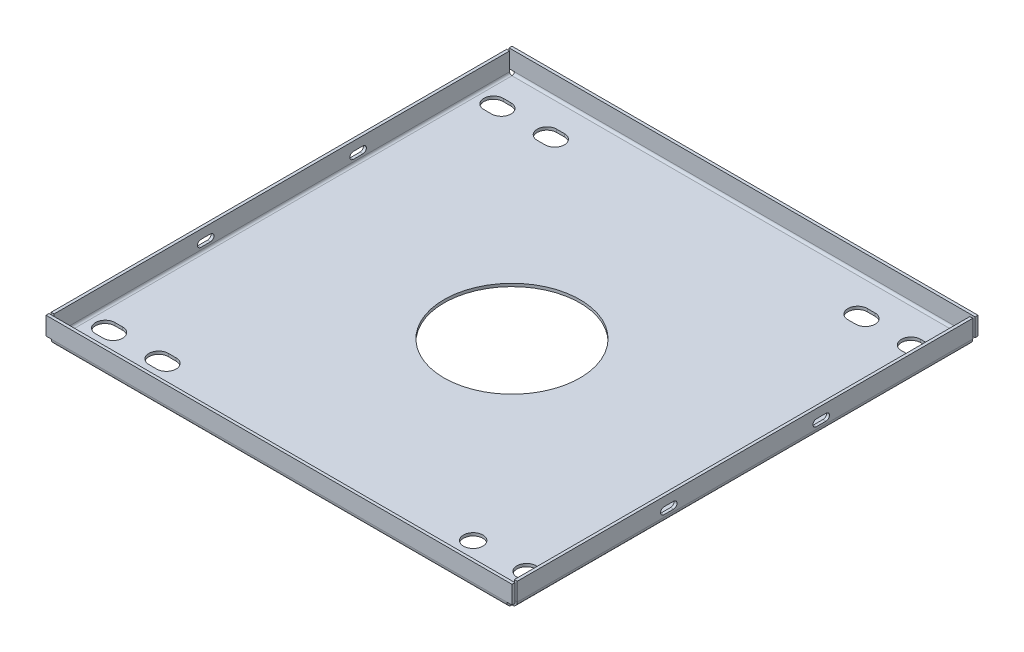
ISO-10303-21;
HEADER;
FILE_DESCRIPTION(('STEP AP214'),'2;1');
FILE_NAME('part.step','',(''),(''),'','','');
FILE_SCHEMA(('AUTOMOTIVE_DESIGN { 1 0 10303 214 1 1 1 1 }'));
ENDSEC;
DATA;
#1=APPLICATION_CONTEXT('core data for automotive mechanical design processes');
#2=APPLICATION_PROTOCOL_DEFINITION('international standard','automotive_design',2000,#1);
#3=PRODUCT_CONTEXT('',#1,'mechanical');
#4=PRODUCT('Part','Part','',(#3));
#5=PRODUCT_RELATED_PRODUCT_CATEGORY('part','',(#4));
#6=PRODUCT_DEFINITION_FORMATION('','',#4);
#7=PRODUCT_DEFINITION_CONTEXT('part definition',#1,'design');
#8=PRODUCT_DEFINITION('design','',#6,#7);
#9=PRODUCT_DEFINITION_SHAPE('','',#8);
#10=(LENGTH_UNIT() NAMED_UNIT(*) SI_UNIT(.MILLI.,.METRE.));
#11=(NAMED_UNIT(*) PLANE_ANGLE_UNIT() SI_UNIT($,.RADIAN.));
#12=(NAMED_UNIT(*) SI_UNIT($,.STERADIAN.) SOLID_ANGLE_UNIT());
#13=UNCERTAINTY_MEASURE_WITH_UNIT(LENGTH_MEASURE(1.E-05),#10,'distance_accuracy_value','');
#14=(GEOMETRIC_REPRESENTATION_CONTEXT(3) GLOBAL_UNCERTAINTY_ASSIGNED_CONTEXT((#13)) GLOBAL_UNIT_ASSIGNED_CONTEXT((#10,
#11,#12)) REPRESENTATION_CONTEXT('',''));
#15=CARTESIAN_POINT('',(0.,0.,0.));
#16=DIRECTION('',(0.,0.,1.));
#17=DIRECTION('',(1.,0.,0.));
#18=AXIS2_PLACEMENT_3D('',#15,#16,#17);
#19=CARTESIAN_POINT('',(0.,0.,0.));
#20=DIRECTION('',(0.,1.,0.));
#21=DIRECTION('',(0.,0.,1.));
#22=AXIS2_PLACEMENT_3D('',#19,#20,#21);
#23=PLANE('',#22);
#24=DIRECTION('',(-1.,0.,0.));
#25=VECTOR('',#24,1.);
#26=CARTESIAN_POINT('',(0.,0.,95.));
#27=LINE('',#26,#25);
#28=CARTESIAN_POINT('',(-105.5,0.,95.));
#29=VERTEX_POINT('',#28);
#30=CARTESIAN_POINT('',(-109.5,0.,95.));
#31=VERTEX_POINT('',#30);
#32=EDGE_CURVE('E1022',#29,#31,#27,.T.);
#33=ORIENTED_EDGE('',*,*,#32,.F.);
#34=CARTESIAN_POINT('',(-105.5,0.,100.));
#35=DIRECTION('',(0.,1.,0.));
#36=DIRECTION('',(0.,0.,1.));
#37=AXIS2_PLACEMENT_3D('',#34,#35,#36);
#38=CIRCLE('',#37,5.);
#39=CARTESIAN_POINT('',(-105.5,0.,105.));
#40=VERTEX_POINT('',#39);
#41=EDGE_CURVE('E1037',#40,#29,#38,.T.);
#42=ORIENTED_EDGE('',*,*,#41,.F.);
#43=DIRECTION('',(1.,0.,0.));
#44=VECTOR('',#43,1.);
#45=CARTESIAN_POINT('',(-109.5,0.,105.));
#46=LINE('',#45,#44);
#47=CARTESIAN_POINT('',(-109.5,0.,105.));
#48=VERTEX_POINT('',#47);
#49=EDGE_CURVE('E1020',#48,#40,#46,.T.);
#50=ORIENTED_EDGE('',*,*,#49,.F.);
#51=CARTESIAN_POINT('',(-109.5,0.,100.));
#52=DIRECTION('',(0.,1.,0.));
#53=DIRECTION('',(0.,0.,1.));
#54=AXIS2_PLACEMENT_3D('',#51,#52,#53);
#55=CIRCLE('',#54,5.);
#56=EDGE_CURVE('E1019',#31,#48,#55,.T.);
#57=ORIENTED_EDGE('',*,*,#56,.F.);
#58=EDGE_LOOP('',(#33,#42,#50,#57));
#59=FACE_BOUND('',#58,.T.);
#60=DIRECTION('',(1.,0.,0.));
#61=VECTOR('',#60,1.);
#62=CARTESIAN_POINT('',(105.5,0.,-95.));
#63=LINE('',#62,#61);
#64=CARTESIAN_POINT('',(105.5,0.,-95.));
#65=VERTEX_POINT('',#64);
#66=CARTESIAN_POINT('',(109.5,0.,-95.));
#67=VERTEX_POINT('',#66);
#68=EDGE_CURVE('E1114',#65,#67,#63,.T.);
#69=ORIENTED_EDGE('',*,*,#68,.F.);
#70=CARTESIAN_POINT('',(105.5,0.,-100.));
#71=DIRECTION('',(0.,1.,0.));
#72=DIRECTION('',(0.,0.,1.));
#73=AXIS2_PLACEMENT_3D('',#70,#71,#72);
#74=CIRCLE('',#73,5.);
#75=CARTESIAN_POINT('',(105.5,0.,-105.));
#76=VERTEX_POINT('',#75);
#77=EDGE_CURVE('E1141',#76,#65,#74,.T.);
#78=ORIENTED_EDGE('',*,*,#77,.F.);
#79=DIRECTION('',(-1.,0.,0.));
#80=VECTOR('',#79,1.);
#81=CARTESIAN_POINT('',(0.,0.,-105.));
#82=LINE('',#81,#80);
#83=CARTESIAN_POINT('',(109.5,0.,-105.));
#84=VERTEX_POINT('',#83);
#85=EDGE_CURVE('E1143',#84,#76,#82,.T.);
#86=ORIENTED_EDGE('',*,*,#85,.F.);
#87=CARTESIAN_POINT('',(109.5,0.,-100.));
#88=DIRECTION('',(0.,1.,0.));
#89=DIRECTION('',(0.,0.,1.));
#90=AXIS2_PLACEMENT_3D('',#87,#88,#89);
#91=CIRCLE('',#90,5.);
#92=EDGE_CURVE('E1161',#67,#84,#91,.T.);
#93=ORIENTED_EDGE('',*,*,#92,.F.);
#94=EDGE_LOOP('',(#69,#78,#86,#93));
#95=FACE_BOUND('',#94,.T.);
#96=CARTESIAN_POINT('',(111.250000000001,0.,86.75));
#97=DIRECTION('',(0.,1.,0.));
#98=DIRECTION('',(0.,0.,1.));
#99=AXIS2_PLACEMENT_3D('',#96,#97,#98);
#100=CIRCLE('',#99,1.5);
#101=CARTESIAN_POINT('',(111.250000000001,0.,88.25));
#102=VERTEX_POINT('',#101);
#103=EDGE_CURVE('E1266',#102,#102,#100,.T.);
#104=ORIENTED_EDGE('',*,*,#103,.F.);
#105=EDGE_LOOP('',(#104));
#106=FACE_BOUND('',#105,.T.);
#107=CARTESIAN_POINT('',(80.0000000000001,0.,100.));
#108=DIRECTION('',(0.,1.,0.));
#109=DIRECTION('',(0.,0.,1.));
#110=AXIS2_PLACEMENT_3D('',#107,#108,#109);
#111=CIRCLE('',#110,5.00000000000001);
#112=CARTESIAN_POINT('',(80.0000000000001,0.,105.));
#113=VERTEX_POINT('',#112);
#114=EDGE_CURVE('E1283',#113,#113,#111,.T.);
#115=ORIENTED_EDGE('',*,*,#114,.F.);
#116=EDGE_LOOP('',(#115));
#117=FACE_BOUND('',#116,.T.);
#118=CARTESIAN_POINT('',(0.,0.,0.));
#119=DIRECTION('',(0.,1.,0.));
#120=DIRECTION('',(0.,0.,1.));
#121=AXIS2_PLACEMENT_3D('',#118,#119,#120);
#122=CIRCLE('',#121,35.);
#123=CARTESIAN_POINT('',(0.,0.,35.));
#124=VERTEX_POINT('',#123);
#125=EDGE_CURVE('E1276',#124,#124,#122,.T.);
#126=ORIENTED_EDGE('',*,*,#125,.F.);
#127=EDGE_LOOP('',(#126));
#128=FACE_BOUND('',#127,.T.);
#129=CARTESIAN_POINT('',(107.5,0.,100.));
#130=DIRECTION('',(0.,1.,0.));
#131=DIRECTION('',(0.,0.,1.));
#132=AXIS2_PLACEMENT_3D('',#129,#130,#131);
#133=CIRCLE('',#132,5.00000000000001);
#134=CARTESIAN_POINT('',(107.5,0.,105.));
#135=VERTEX_POINT('',#134);
#136=EDGE_CURVE('E1272',#135,#135,#133,.T.);
#137=ORIENTED_EDGE('',*,*,#136,.F.);
#138=EDGE_LOOP('',(#137));
#139=FACE_BOUND('',#138,.T.);
#140=DIRECTION('',(1.,0.,0.));
#141=VECTOR('',#140,1.);
#142=CARTESIAN_POINT('',(120.,0.,117.3));
#143=LINE('',#142,#141);
#144=CARTESIAN_POINT('',(117.3,0.,117.3));
#145=VERTEX_POINT('',#144);
#146=CARTESIAN_POINT('',(-117.3,0.,117.3));
#147=VERTEX_POINT('',#146);
#148=EDGE_CURVE('E1441',#145,#147,#143,.F.);
#149=ORIENTED_EDGE('',*,*,#148,.F.);
#150=DIRECTION('',(0.,0.,-1.));
#151=VECTOR('',#150,1.);
#152=CARTESIAN_POINT('',(117.3,0.,-117.3));
#153=LINE('',#152,#151);
#154=CARTESIAN_POINT('',(117.3,0.,-117.3));
#155=VERTEX_POINT('',#154);
#156=EDGE_CURVE('E1334',#155,#145,#153,.F.);
#157=ORIENTED_EDGE('',*,*,#156,.F.);
#158=DIRECTION('',(-1.,0.,0.));
#159=VECTOR('',#158,1.);
#160=CARTESIAN_POINT('',(-120.,0.,-117.3));
#161=LINE('',#160,#159);
#162=CARTESIAN_POINT('',(-117.3,0.,-117.3));
#163=VERTEX_POINT('',#162);
#164=EDGE_CURVE('E1401',#163,#155,#161,.F.);
#165=ORIENTED_EDGE('',*,*,#164,.F.);
#166=DIRECTION('',(0.,0.,1.));
#167=VECTOR('',#166,1.);
#168=CARTESIAN_POINT('',(-117.3,0.,117.3));
#169=LINE('',#168,#167);
#170=EDGE_CURVE('E1388',#147,#163,#169,.F.);
#171=ORIENTED_EDGE('',*,*,#170,.F.);
#172=EDGE_LOOP('',(#149,#157,#165,#171));
#173=FACE_BOUND('',#172,.T.);
#174=CARTESIAN_POINT('',(78.0000000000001,0.,-100.));
#175=DIRECTION('',(0.,1.,0.));
#176=DIRECTION('',(0.,0.,1.));
#177=AXIS2_PLACEMENT_3D('',#174,#175,#176);
#178=CIRCLE('',#177,5.);
#179=CARTESIAN_POINT('',(78.0000000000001,0.,-105.));
#180=VERTEX_POINT('',#179);
#181=CARTESIAN_POINT('',(78.0000000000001,0.,-95.0000000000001));
#182=VERTEX_POINT('',#181);
#183=EDGE_CURVE('E1110',#180,#182,#178,.T.);
#184=ORIENTED_EDGE('',*,*,#183,.F.);
#185=DIRECTION('',(1.,0.,0.));
#186=VECTOR('',#185,1.);
#187=CARTESIAN_POINT('',(78.0000000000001,0.,-105.));
#188=LINE('',#187,#186);
#189=CARTESIAN_POINT('',(82.0000000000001,0.,-105.));
#190=VERTEX_POINT('',#189);
#191=EDGE_CURVE('E1113',#180,#190,#188,.T.);
#192=ORIENTED_EDGE('',*,*,#191,.T.);
#193=CARTESIAN_POINT('',(82.0000000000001,0.,-100.));
#194=DIRECTION('',(0.,1.,0.));
#195=DIRECTION('',(0.,0.,1.));
#196=AXIS2_PLACEMENT_3D('',#193,#194,#195);
#197=CIRCLE('',#196,5.);
#198=CARTESIAN_POINT('',(82.0000000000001,0.,-95.));
#199=VERTEX_POINT('',#198);
#200=EDGE_CURVE('E1130',#199,#190,#197,.T.);
#201=ORIENTED_EDGE('',*,*,#200,.F.);
#202=DIRECTION('',(1.,0.,0.));
#203=VECTOR('',#202,1.);
#204=CARTESIAN_POINT('',(78.0000000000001,0.,-95.));
#205=LINE('',#204,#203);
#206=EDGE_CURVE('E1111',#182,#199,#205,.T.);
#207=ORIENTED_EDGE('',*,*,#206,.F.);
#208=EDGE_LOOP('',(#184,#192,#201,#207));
#209=FACE_BOUND('',#208,.T.);
#210=CARTESIAN_POINT('',(-82.0000000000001,0.,-100.));
#211=DIRECTION('',(0.,1.,0.));
#212=DIRECTION('',(0.,0.,1.));
#213=AXIS2_PLACEMENT_3D('',#210,#211,#212);
#214=CIRCLE('',#213,5.);
#215=CARTESIAN_POINT('',(-82.0000000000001,0.,-105.));
#216=VERTEX_POINT('',#215);
#217=CARTESIAN_POINT('',(-82.0000000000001,0.,-95.0000000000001));
#218=VERTEX_POINT('',#217);
#219=EDGE_CURVE('E1082',#216,#218,#214,.T.);
#220=ORIENTED_EDGE('',*,*,#219,.F.);
#221=DIRECTION('',(1.,0.,0.));
#222=VECTOR('',#221,1.);
#223=CARTESIAN_POINT('',(-82.0000000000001,0.,-105.));
#224=LINE('',#223,#222);
#225=CARTESIAN_POINT('',(-78.0000000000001,0.,-105.));
#226=VERTEX_POINT('',#225);
#227=EDGE_CURVE('E1056',#216,#226,#224,.T.);
#228=ORIENTED_EDGE('',*,*,#227,.T.);
#229=CARTESIAN_POINT('',(-78.0000000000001,0.,-100.));
#230=DIRECTION('',(0.,1.,0.));
#231=DIRECTION('',(0.,0.,1.));
#232=AXIS2_PLACEMENT_3D('',#229,#230,#231);
#233=CIRCLE('',#232,5.);
#234=CARTESIAN_POINT('',(-78.0000000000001,0.,-95.));
#235=VERTEX_POINT('',#234);
#236=EDGE_CURVE('E1099',#235,#226,#233,.T.);
#237=ORIENTED_EDGE('',*,*,#236,.F.);
#238=DIRECTION('',(1.,0.,0.));
#239=VECTOR('',#238,1.);
#240=CARTESIAN_POINT('',(-82.0000000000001,0.,-95.));
#241=LINE('',#240,#239);
#242=EDGE_CURVE('E1080',#218,#235,#241,.T.);
#243=ORIENTED_EDGE('',*,*,#242,.F.);
#244=EDGE_LOOP('',(#220,#228,#237,#243));
#245=FACE_BOUND('',#244,.T.);
#246=CARTESIAN_POINT('',(-109.5,0.,-100.));
#247=DIRECTION('',(0.,1.,0.));
#248=DIRECTION('',(0.,0.,1.));
#249=AXIS2_PLACEMENT_3D('',#246,#247,#248);
#250=CIRCLE('',#249,5.);
#251=CARTESIAN_POINT('',(-109.5,0.,-105.));
#252=VERTEX_POINT('',#251);
#253=CARTESIAN_POINT('',(-109.5,0.,-95.));
#254=VERTEX_POINT('',#253);
#255=EDGE_CURVE('E1050',#252,#254,#250,.T.);
#256=ORIENTED_EDGE('',*,*,#255,.F.);
#257=DIRECTION('',(1.,0.,0.));
#258=VECTOR('',#257,1.);
#259=CARTESIAN_POINT('',(-109.5,0.,-105.));
#260=LINE('',#259,#258);
#261=CARTESIAN_POINT('',(-105.5,0.,-105.));
#262=VERTEX_POINT('',#261);
#263=EDGE_CURVE('E1023',#252,#262,#260,.T.);
#264=ORIENTED_EDGE('',*,*,#263,.T.);
#265=CARTESIAN_POINT('',(-105.5,0.,-100.));
#266=DIRECTION('',(0.,1.,0.));
#267=DIRECTION('',(0.,0.,1.));
#268=AXIS2_PLACEMENT_3D('',#265,#266,#267);
#269=CIRCLE('',#268,5.);
#270=CARTESIAN_POINT('',(-105.5,0.,-95.));
#271=VERTEX_POINT('',#270);
#272=EDGE_CURVE('E1069',#271,#262,#269,.T.);
#273=ORIENTED_EDGE('',*,*,#272,.F.);
#274=DIRECTION('',(1.,0.,0.));
#275=VECTOR('',#274,1.);
#276=CARTESIAN_POINT('',(-109.5,0.,-95.));
#277=LINE('',#276,#275);
#278=EDGE_CURVE('E1048',#254,#271,#277,.T.);
#279=ORIENTED_EDGE('',*,*,#278,.F.);
#280=EDGE_LOOP('',(#256,#264,#273,#279));
#281=FACE_BOUND('',#280,.T.);
#282=CARTESIAN_POINT('',(-82.0000000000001,0.,100.));
#283=DIRECTION('',(0.,1.,0.));
#284=DIRECTION('',(0.,0.,1.));
#285=AXIS2_PLACEMENT_3D('',#282,#283,#284);
#286=CIRCLE('',#285,5.);
#287=CARTESIAN_POINT('',(-82.0000000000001,0.,95.0000000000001));
#288=VERTEX_POINT('',#287);
#289=CARTESIAN_POINT('',(-82.0000000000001,0.,105.));
#290=VERTEX_POINT('',#289);
#291=EDGE_CURVE('E1008',#288,#290,#286,.T.);
#292=ORIENTED_EDGE('',*,*,#291,.F.);
#293=DIRECTION('',(-1.,0.,0.));
#294=VECTOR('',#293,1.);
#295=CARTESIAN_POINT('',(0.,0.,95.0000000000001));
#296=LINE('',#295,#294);
#297=CARTESIAN_POINT('',(-78.0000000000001,0.,95.0000000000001));
#298=VERTEX_POINT('',#297);
#299=EDGE_CURVE('E16',#298,#288,#296,.T.);
#300=ORIENTED_EDGE('',*,*,#299,.F.);
#301=CARTESIAN_POINT('',(-78.0000000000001,0.,100.));
#302=DIRECTION('',(0.,1.,0.));
#303=DIRECTION('',(0.,0.,1.));
#304=AXIS2_PLACEMENT_3D('',#301,#302,#303);
#305=CIRCLE('',#304,5.);
#306=CARTESIAN_POINT('',(-78.0000000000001,0.,105.));
#307=VERTEX_POINT('',#306);
#308=EDGE_CURVE('E1002',#307,#298,#305,.T.);
#309=ORIENTED_EDGE('',*,*,#308,.F.);
#310=DIRECTION('',(1.,0.,0.));
#311=VECTOR('',#310,1.);
#312=CARTESIAN_POINT('',(-82.0000000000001,0.,105.));
#313=LINE('',#312,#311);
#314=EDGE_CURVE('E595',#290,#307,#313,.T.);
#315=ORIENTED_EDGE('',*,*,#314,.F.);
#316=EDGE_LOOP('',(#292,#300,#309,#315));
#317=FACE_BOUND('',#316,.T.);
#318=ADVANCED_FACE('F587',(#59,#95,#106,#117,#128,#139,#173,#209,#245,#281,#317),#23,.T.);
#319=CARTESIAN_POINT('',(0.,1.19999999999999,0.));
#320=DIRECTION('',(0.,1.,0.));
#321=DIRECTION('',(0.,0.,1.));
#322=AXIS2_PLACEMENT_3D('',#319,#320,#321);
#323=PLANE('',#322);
#324=DIRECTION('',(0.,0.,1.));
#325=VECTOR('',#324,1.);
#326=CARTESIAN_POINT('',(117.3,1.19999999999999,118.5));
#327=LINE('',#326,#325);
#328=CARTESIAN_POINT('',(117.3,1.19999999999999,118.5));
#329=VERTEX_POINT('',#328);
#330=CARTESIAN_POINT('',(117.3,1.19999999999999,120.));
#331=VERTEX_POINT('',#330);
#332=EDGE_CURVE('E1506',#329,#331,#327,.T.);
#333=ORIENTED_EDGE('',*,*,#332,.F.);
#334=DIRECTION('',(1.,0.,0.));
#335=VECTOR('',#334,1.);
#336=CARTESIAN_POINT('',(-120.,1.19999999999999,118.5));
#337=LINE('',#336,#335);
#338=CARTESIAN_POINT('',(120.,1.19999999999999,118.5));
#339=VERTEX_POINT('',#338);
#340=EDGE_CURVE('E1470',#329,#339,#337,.T.);
#341=ORIENTED_EDGE('',*,*,#340,.T.);
#342=DIRECTION('',(0.,0.,-1.));
#343=VECTOR('',#342,1.);
#344=CARTESIAN_POINT('',(120.,1.19999999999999,118.5));
#345=LINE('',#344,#343);
#346=CARTESIAN_POINT('',(120.,1.19999999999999,120.));
#347=VERTEX_POINT('',#346);
#348=EDGE_CURVE('E1464',#339,#347,#345,.F.);
#349=ORIENTED_EDGE('',*,*,#348,.T.);
#350=DIRECTION('',(1.,0.,0.));
#351=VECTOR('',#350,1.);
#352=CARTESIAN_POINT('',(-120.,1.19999999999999,120.));
#353=LINE('',#352,#351);
#354=EDGE_CURVE('E1459',#347,#331,#353,.F.);
#355=ORIENTED_EDGE('',*,*,#354,.T.);
#356=EDGE_LOOP('',(#333,#341,#349,#355));
#357=FACE_BOUND('',#356,.T.);
#358=ADVANCED_FACE('F589',(#357),#323,.F.);
#359=CARTESIAN_POINT('',(120.,1.19999999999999,117.3));
#360=DIRECTION('',(1.,0.,0.));
#361=DIRECTION('',(0.,0.,1.));
#362=AXIS2_PLACEMENT_3D('',#359,#360,#361);
#363=CYLINDRICAL_SURFACE('',#362,2.70000000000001);
#364=DIRECTION('',(1.,0.,0.));
#365=VECTOR('',#364,1.);
#366=CARTESIAN_POINT('',(120.,-1.50000000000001,117.3));
#367=LINE('',#366,#365);
#368=CARTESIAN_POINT('',(117.3,-1.5,117.3));
#369=VERTEX_POINT('',#368);
#370=CARTESIAN_POINT('',(-117.3,-1.50000000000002,117.3));
#371=VERTEX_POINT('',#370);
#372=EDGE_CURVE('E1473',#369,#371,#367,.F.);
#373=ORIENTED_EDGE('',*,*,#372,.F.);
#374=CARTESIAN_POINT('',(117.3,1.19999999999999,117.3));
#375=DIRECTION('',(1.,0.,0.));
#376=DIRECTION('',(0.,0.,-1.));
#377=AXIS2_PLACEMENT_3D('',#374,#375,#376);
#378=CIRCLE('',#377,2.70000000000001);
#379=EDGE_CURVE('E1503',#369,#331,#378,.F.);
#380=ORIENTED_EDGE('',*,*,#379,.T.);
#381=CARTESIAN_POINT('',(-117.3,1.19999999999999,120.));
#382=VERTEX_POINT('',#381);
#383=EDGE_CURVE('E1462',#331,#382,#353,.F.);
#384=ORIENTED_EDGE('',*,*,#383,.T.);
#385=CARTESIAN_POINT('',(-117.3,1.19999999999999,117.3));
#386=DIRECTION('',(-1.,0.,0.));
#387=DIRECTION('',(0.,0.,1.));
#388=AXIS2_PLACEMENT_3D('',#385,#386,#387);
#389=CIRCLE('',#388,2.70000000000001);
#390=EDGE_CURVE('E1485',#382,#371,#389,.F.);
#391=ORIENTED_EDGE('',*,*,#390,.T.);
#392=EDGE_LOOP('',(#373,#380,#384,#391));
#393=FACE_BOUND('',#392,.T.);
#394=ADVANCED_FACE('F1568',(#393),#363,.T.);
#395=CARTESIAN_POINT('',(117.3,1.19999999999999,117.3));
#396=DIRECTION('',(1.,0.,0.));
#397=DIRECTION('',(0.,0.,-1.));
#398=AXIS2_PLACEMENT_3D('',#395,#396,#397);
#399=PLANE('',#398);
#400=CARTESIAN_POINT('',(117.3,1.19999999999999,117.3));
#401=DIRECTION('',(1.,0.,0.));
#402=DIRECTION('',(0.,0.,-1.));
#403=AXIS2_PLACEMENT_3D('',#400,#401,#402);
#404=CIRCLE('',#403,1.20000000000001);
#405=EDGE_CURVE('E1500',#145,#329,#404,.F.);
#406=ORIENTED_EDGE('',*,*,#405,.T.);
#407=ORIENTED_EDGE('',*,*,#332,.T.);
#408=ORIENTED_EDGE('',*,*,#379,.F.);
#409=DIRECTION('',(0.,-1.,0.));
#410=VECTOR('',#409,1.);
#411=CARTESIAN_POINT('',(117.3,0.,117.3));
#412=LINE('',#411,#410);
#413=EDGE_CURVE('E1339',#145,#369,#412,.T.);
#414=ORIENTED_EDGE('',*,*,#413,.F.);
#415=EDGE_LOOP('',(#406,#407,#408,#414));
#416=FACE_BOUND('',#415,.T.);
#417=ADVANCED_FACE('F1597',(#416),#399,.T.);
#418=CARTESIAN_POINT('',(0.,1.19999999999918,0.));
#419=DIRECTION('',(0.,-1.,0.));
#420=DIRECTION('',(0.,0.,-1.));
#421=AXIS2_PLACEMENT_3D('',#418,#419,#420);
#422=PLANE('',#421);
#423=DIRECTION('',(0.,0.,1.));
#424=VECTOR('',#423,1.);
#425=CARTESIAN_POINT('',(117.3,1.2,-120.));
#426=LINE('',#425,#424);
#427=CARTESIAN_POINT('',(117.3,1.2,-120.));
#428=VERTEX_POINT('',#427);
#429=CARTESIAN_POINT('',(117.3,1.19999999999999,-118.5));
#430=VERTEX_POINT('',#429);
#431=EDGE_CURVE('E1498',#428,#430,#426,.T.);
#432=ORIENTED_EDGE('',*,*,#431,.F.);
#433=DIRECTION('',(-1.,0.,0.));
#434=VECTOR('',#433,1.);
#435=CARTESIAN_POINT('',(120.,1.2,-120.));
#436=LINE('',#435,#434);
#437=CARTESIAN_POINT('',(120.,1.19999999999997,-120.));
#438=VERTEX_POINT('',#437);
#439=EDGE_CURVE('E1423',#428,#438,#436,.F.);
#440=ORIENTED_EDGE('',*,*,#439,.T.);
#441=DIRECTION('',(0.,0.,1.));
#442=VECTOR('',#441,1.);
#443=CARTESIAN_POINT('',(120.,1.2,-120.));
#444=LINE('',#443,#442);
#445=CARTESIAN_POINT('',(120.,1.19999999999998,-118.5));
#446=VERTEX_POINT('',#445);
#447=EDGE_CURVE('E1396',#446,#438,#444,.F.);
#448=ORIENTED_EDGE('',*,*,#447,.F.);
#449=DIRECTION('',(-1.,0.,0.));
#450=VECTOR('',#449,1.);
#451=CARTESIAN_POINT('',(120.,1.19999999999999,-118.5));
#452=LINE('',#451,#450);
#453=EDGE_CURVE('E1426',#446,#430,#452,.T.);
#454=ORIENTED_EDGE('',*,*,#453,.T.);
#455=EDGE_LOOP('',(#432,#440,#448,#454));
#456=FACE_BOUND('',#455,.T.);
#457=ADVANCED_FACE('F1594',(#456),#422,.T.);
#458=CARTESIAN_POINT('',(-120.,1.2,-117.3));
#459=DIRECTION('',(-1.,0.,0.));
#460=DIRECTION('',(0.,0.,-1.));
#461=AXIS2_PLACEMENT_3D('',#458,#459,#460);
#462=CYLINDRICAL_SURFACE('',#461,2.70000000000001);
#463=CARTESIAN_POINT('',(-117.3,1.20000000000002,-120.));
#464=VERTEX_POINT('',#463);
#465=EDGE_CURVE('E1422',#464,#428,#436,.F.);
#466=ORIENTED_EDGE('',*,*,#465,.T.);
#467=CARTESIAN_POINT('',(117.3,1.19999999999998,-117.3));
#468=DIRECTION('',(1.,0.,0.));
#469=DIRECTION('',(0.,0.,-1.));
#470=AXIS2_PLACEMENT_3D('',#467,#468,#469);
#471=CIRCLE('',#470,2.70000000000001);
#472=CARTESIAN_POINT('',(117.3,-1.50000000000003,-117.3));
#473=VERTEX_POINT('',#472);
#474=EDGE_CURVE('E1493',#428,#473,#471,.F.);
#475=ORIENTED_EDGE('',*,*,#474,.T.);
#476=DIRECTION('',(-1.,0.,0.));
#477=VECTOR('',#476,1.);
#478=CARTESIAN_POINT('',(-120.,-1.5,-117.3));
#479=LINE('',#478,#477);
#480=CARTESIAN_POINT('',(-117.3,-1.5,-117.3));
#481=VERTEX_POINT('',#480);
#482=EDGE_CURVE('E1433',#481,#473,#479,.F.);
#483=ORIENTED_EDGE('',*,*,#482,.F.);
#484=CARTESIAN_POINT('',(-117.3,1.2,-117.3));
#485=DIRECTION('',(-1.,0.,0.));
#486=DIRECTION('',(0.,0.,1.));
#487=AXIS2_PLACEMENT_3D('',#484,#485,#486);
#488=CIRCLE('',#487,2.70000000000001);
#489=EDGE_CURVE('E1480',#481,#464,#488,.F.);
#490=ORIENTED_EDGE('',*,*,#489,.T.);
#491=EDGE_LOOP('',(#466,#475,#483,#490));
#492=FACE_BOUND('',#491,.T.);
#493=ADVANCED_FACE('F1596',(#492),#462,.T.);
#494=CARTESIAN_POINT('',(0.,-1.5,0.));
#495=DIRECTION('',(0.,1.,0.));
#496=DIRECTION('',(0.,0.,1.));
#497=AXIS2_PLACEMENT_3D('',#494,#495,#496);
#498=PLANE('',#497);
#499=CARTESIAN_POINT('',(111.250000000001,-1.50000000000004,86.75));
#500=DIRECTION('',(0.,1.,0.));
#501=DIRECTION('',(0.,0.,1.));
#502=AXIS2_PLACEMENT_3D('',#499,#500,#501);
#503=CIRCLE('',#502,1.5);
#504=CARTESIAN_POINT('',(111.250000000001,-1.50000000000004,88.25));
#505=VERTEX_POINT('',#504);
#506=EDGE_CURVE('E1269',#505,#505,#503,.T.);
#507=ORIENTED_EDGE('',*,*,#506,.T.);
#508=EDGE_LOOP('',(#507));
#509=FACE_BOUND('',#508,.T.);
#510=CARTESIAN_POINT('',(78.0000000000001,-1.50000000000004,-100.));
#511=DIRECTION('',(0.,1.,0.));
#512=DIRECTION('',(0.,0.,1.));
#513=AXIS2_PLACEMENT_3D('',#510,#511,#512);
#514=CIRCLE('',#513,5.);
#515=CARTESIAN_POINT('',(78.0000000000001,-1.50000000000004,-105.));
#516=VERTEX_POINT('',#515);
#517=CARTESIAN_POINT('',(78.0000000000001,-1.50000000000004,-95.0000000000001));
#518=VERTEX_POINT('',#517);
#519=EDGE_CURVE('E1121',#516,#518,#514,.T.);
#520=ORIENTED_EDGE('',*,*,#519,.T.);
#521=DIRECTION('',(1.,0.,0.));
#522=VECTOR('',#521,1.);
#523=CARTESIAN_POINT('',(0.,-1.5,-95.0000000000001));
#524=LINE('',#523,#522);
#525=CARTESIAN_POINT('',(82.0000000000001,-1.50000000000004,-95.0000000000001));
#526=VERTEX_POINT('',#525);
#527=EDGE_CURVE('E1086',#518,#526,#524,.T.);
#528=ORIENTED_EDGE('',*,*,#527,.T.);
#529=CARTESIAN_POINT('',(82.0000000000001,-1.50000000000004,-100.));
#530=DIRECTION('',(0.,1.,0.));
#531=DIRECTION('',(0.,0.,1.));
#532=AXIS2_PLACEMENT_3D('',#529,#530,#531);
#533=CIRCLE('',#532,5.);
#534=CARTESIAN_POINT('',(82.0000000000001,-1.50000000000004,-105.));
#535=VERTEX_POINT('',#534);
#536=EDGE_CURVE('E1133',#526,#535,#533,.T.);
#537=ORIENTED_EDGE('',*,*,#536,.T.);
#538=DIRECTION('',(1.,0.,0.));
#539=VECTOR('',#538,1.);
#540=CARTESIAN_POINT('',(78.0000000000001,-1.50000000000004,-105.));
#541=LINE('',#540,#539);
#542=EDGE_CURVE('E1115',#516,#535,#541,.T.);
#543=ORIENTED_EDGE('',*,*,#542,.F.);
#544=EDGE_LOOP('',(#520,#528,#537,#543));
#545=FACE_BOUND('',#544,.T.);
#546=CARTESIAN_POINT('',(80.0000000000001,-1.50000000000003,100.));
#547=DIRECTION('',(0.,1.,0.));
#548=DIRECTION('',(0.,0.,1.));
#549=AXIS2_PLACEMENT_3D('',#546,#547,#548);
#550=CIRCLE('',#549,5.00000000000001);
#551=CARTESIAN_POINT('',(80.0000000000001,-1.50000000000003,105.));
#552=VERTEX_POINT('',#551);
#553=EDGE_CURVE('E1279',#552,#552,#550,.T.);
#554=ORIENTED_EDGE('',*,*,#553,.T.);
#555=EDGE_LOOP('',(#554));
#556=FACE_BOUND('',#555,.T.);
#557=CARTESIAN_POINT('',(-82.0000000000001,-1.50000000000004,100.));
#558=DIRECTION('',(0.,1.,0.));
#559=DIRECTION('',(0.,0.,1.));
#560=AXIS2_PLACEMENT_3D('',#557,#558,#559);
#561=CIRCLE('',#560,5.);
#562=CARTESIAN_POINT('',(-82.0000000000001,-1.50000000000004,95.0000000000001));
#563=VERTEX_POINT('',#562);
#564=CARTESIAN_POINT('',(-82.0000000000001,-1.50000000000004,105.));
#565=VERTEX_POINT('',#564);
#566=EDGE_CURVE('E992',#563,#565,#561,.T.);
#567=ORIENTED_EDGE('',*,*,#566,.T.);
#568=DIRECTION('',(1.,0.,0.));
#569=VECTOR('',#568,1.);
#570=CARTESIAN_POINT('',(-82.0000000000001,-1.50000000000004,105.));
#571=LINE('',#570,#569);
#572=CARTESIAN_POINT('',(-78.0000000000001,-1.50000000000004,105.));
#573=VERTEX_POINT('',#572);
#574=EDGE_CURVE('E994',#565,#573,#571,.T.);
#575=ORIENTED_EDGE('',*,*,#574,.T.);
#576=CARTESIAN_POINT('',(-78.0000000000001,-1.50000000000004,100.));
#577=DIRECTION('',(0.,1.,0.));
#578=DIRECTION('',(0.,0.,1.));
#579=AXIS2_PLACEMENT_3D('',#576,#577,#578);
#580=CIRCLE('',#579,5.);
#581=CARTESIAN_POINT('',(-78.0000000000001,-1.5,95.0000000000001));
#582=VERTEX_POINT('',#581);
#583=EDGE_CURVE('E993',#573,#582,#580,.T.);
#584=ORIENTED_EDGE('',*,*,#583,.T.);
#585=DIRECTION('',(1.,0.,0.));
#586=VECTOR('',#585,1.);
#587=CARTESIAN_POINT('',(-82.0000000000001,-1.50000000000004,95.0000000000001));
#588=LINE('',#587,#586);
#589=EDGE_CURVE('E987',#563,#582,#588,.T.);
#590=ORIENTED_EDGE('',*,*,#589,.F.);
#591=EDGE_LOOP('',(#567,#575,#584,#590));
#592=FACE_BOUND('',#591,.T.);
#593=CARTESIAN_POINT('',(0.,-1.50000000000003,0.));
#594=DIRECTION('',(0.,1.,0.));
#595=DIRECTION('',(0.,0.,1.));
#596=AXIS2_PLACEMENT_3D('',#593,#594,#595);
#597=CIRCLE('',#596,35.);
#598=CARTESIAN_POINT('',(0.,-1.50000000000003,35.));
#599=VERTEX_POINT('',#598);
#600=EDGE_CURVE('E1286',#599,#599,#597,.T.);
#601=ORIENTED_EDGE('',*,*,#600,.T.);
#602=EDGE_LOOP('',(#601));
#603=FACE_BOUND('',#602,.T.);
#604=DIRECTION('',(1.,0.,0.));
#605=VECTOR('',#604,1.);
#606=CARTESIAN_POINT('',(105.5,-1.50000000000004,-95.));
#607=LINE('',#606,#605);
#608=CARTESIAN_POINT('',(105.5,-1.50000000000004,-95.));
#609=VERTEX_POINT('',#608);
#610=CARTESIAN_POINT('',(109.5,-1.50000000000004,-95.));
#611=VERTEX_POINT('',#610);
#612=EDGE_CURVE('E1144',#609,#611,#607,.T.);
#613=ORIENTED_EDGE('',*,*,#612,.T.);
#614=CARTESIAN_POINT('',(109.5,-1.50000000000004,-100.));
#615=DIRECTION('',(0.,1.,0.));
#616=DIRECTION('',(0.,0.,1.));
#617=AXIS2_PLACEMENT_3D('',#614,#615,#616);
#618=CIRCLE('',#617,5.);
#619=CARTESIAN_POINT('',(109.5,-1.50000000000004,-105.));
#620=VERTEX_POINT('',#619);
#621=EDGE_CURVE('E1164',#611,#620,#618,.T.);
#622=ORIENTED_EDGE('',*,*,#621,.T.);
#623=DIRECTION('',(1.,0.,0.));
#624=VECTOR('',#623,1.);
#625=CARTESIAN_POINT('',(105.5,-1.50000000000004,-105.));
#626=LINE('',#625,#624);
#627=CARTESIAN_POINT('',(105.5,-1.50000000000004,-105.));
#628=VERTEX_POINT('',#627);
#629=EDGE_CURVE('E1147',#628,#620,#626,.T.);
#630=ORIENTED_EDGE('',*,*,#629,.F.);
#631=CARTESIAN_POINT('',(105.5,-1.50000000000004,-100.));
#632=DIRECTION('',(0.,1.,0.));
#633=DIRECTION('',(0.,0.,1.));
#634=AXIS2_PLACEMENT_3D('',#631,#632,#633);
#635=CIRCLE('',#634,5.);
#636=EDGE_CURVE('E1152',#628,#609,#635,.T.);
#637=ORIENTED_EDGE('',*,*,#636,.T.);
#638=EDGE_LOOP('',(#613,#622,#630,#637));
#639=FACE_BOUND('',#638,.T.);
#640=CARTESIAN_POINT('',(107.5,-1.50000000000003,100.));
#641=DIRECTION('',(0.,1.,0.));
#642=DIRECTION('',(0.,0.,1.));
#643=AXIS2_PLACEMENT_3D('',#640,#641,#642);
#644=CIRCLE('',#643,5.00000000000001);
#645=CARTESIAN_POINT('',(107.5,-1.50000000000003,105.));
#646=VERTEX_POINT('',#645);
#647=EDGE_CURVE('E1273',#646,#646,#644,.T.);
#648=ORIENTED_EDGE('',*,*,#647,.T.);
#649=EDGE_LOOP('',(#648));
#650=FACE_BOUND('',#649,.T.);
#651=CARTESIAN_POINT('',(-109.5,-1.50000000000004,100.));
#652=DIRECTION('',(0.,1.,0.));
#653=DIRECTION('',(0.,0.,1.));
#654=AXIS2_PLACEMENT_3D('',#651,#652,#653);
#655=CIRCLE('',#654,5.);
#656=CARTESIAN_POINT('',(-109.5,-1.50000000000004,95.));
#657=VERTEX_POINT('',#656);
#658=CARTESIAN_POINT('',(-109.5,-1.50000000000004,105.));
#659=VERTEX_POINT('',#658);
#660=EDGE_CURVE('E1028',#657,#659,#655,.T.);
#661=ORIENTED_EDGE('',*,*,#660,.T.);
#662=DIRECTION('',(1.,0.,0.));
#663=VECTOR('',#662,1.);
#664=CARTESIAN_POINT('',(0.,-1.5,105.));
#665=LINE('',#664,#663);
#666=CARTESIAN_POINT('',(-105.5,-1.50000000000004,105.));
#667=VERTEX_POINT('',#666);
#668=EDGE_CURVE('E995',#659,#667,#665,.T.);
#669=ORIENTED_EDGE('',*,*,#668,.T.);
#670=CARTESIAN_POINT('',(-105.5,-1.50000000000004,100.));
#671=DIRECTION('',(0.,1.,0.));
#672=DIRECTION('',(0.,0.,1.));
#673=AXIS2_PLACEMENT_3D('',#670,#671,#672);
#674=CIRCLE('',#673,5.);
#675=CARTESIAN_POINT('',(-105.5,-1.50000000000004,95.));
#676=VERTEX_POINT('',#675);
#677=EDGE_CURVE('E1040',#667,#676,#674,.T.);
#678=ORIENTED_EDGE('',*,*,#677,.T.);
#679=DIRECTION('',(1.,0.,0.));
#680=VECTOR('',#679,1.);
#681=CARTESIAN_POINT('',(-109.5,-1.50000000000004,95.));
#682=LINE('',#681,#680);
#683=EDGE_CURVE('E1024',#657,#676,#682,.T.);
#684=ORIENTED_EDGE('',*,*,#683,.F.);
#685=EDGE_LOOP('',(#661,#669,#678,#684));
#686=FACE_BOUND('',#685,.T.);
#687=DIRECTION('',(1.,0.,0.));
#688=VECTOR('',#687,1.);
#689=CARTESIAN_POINT('',(-109.5,-1.50000000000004,-95.));
#690=LINE('',#689,#688);
#691=CARTESIAN_POINT('',(-109.5,-1.50000000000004,-95.));
#692=VERTEX_POINT('',#691);
#693=CARTESIAN_POINT('',(-105.5,-1.50000000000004,-95.));
#694=VERTEX_POINT('',#693);
#695=EDGE_CURVE('E1051',#692,#694,#690,.T.);
#696=ORIENTED_EDGE('',*,*,#695,.T.);
#697=CARTESIAN_POINT('',(-105.5,-1.50000000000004,-100.));
#698=DIRECTION('',(0.,1.,0.));
#699=DIRECTION('',(0.,0.,1.));
#700=AXIS2_PLACEMENT_3D('',#697,#698,#699);
#701=CIRCLE('',#700,5.);
#702=CARTESIAN_POINT('',(-105.5,-1.50000000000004,-105.));
#703=VERTEX_POINT('',#702);
#704=EDGE_CURVE('E1072',#694,#703,#701,.T.);
#705=ORIENTED_EDGE('',*,*,#704,.T.);
#706=DIRECTION('',(1.,0.,0.));
#707=VECTOR('',#706,1.);
#708=CARTESIAN_POINT('',(-109.5,-1.50000000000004,-105.));
#709=LINE('',#708,#707);
#710=CARTESIAN_POINT('',(-109.5,-1.50000000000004,-105.));
#711=VERTEX_POINT('',#710);
#712=EDGE_CURVE('E1054',#711,#703,#709,.T.);
#713=ORIENTED_EDGE('',*,*,#712,.F.);
#714=CARTESIAN_POINT('',(-109.5,-1.50000000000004,-100.));
#715=DIRECTION('',(0.,1.,0.));
#716=DIRECTION('',(0.,0.,1.));
#717=AXIS2_PLACEMENT_3D('',#714,#715,#716);
#718=CIRCLE('',#717,5.);
#719=EDGE_CURVE('E1061',#711,#692,#718,.T.);
#720=ORIENTED_EDGE('',*,*,#719,.T.);
#721=EDGE_LOOP('',(#696,#705,#713,#720));
#722=FACE_BOUND('',#721,.T.);
#723=DIRECTION('',(1.,0.,0.));
#724=VECTOR('',#723,1.);
#725=CARTESIAN_POINT('',(0.,-1.5,-95.0000000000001));
#726=LINE('',#725,#724);
#727=CARTESIAN_POINT('',(-82.0000000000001,-1.50000000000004,-95.0000000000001));
#728=VERTEX_POINT('',#727);
#729=CARTESIAN_POINT('',(-78.0000000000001,-1.50000000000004,-95.0000000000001));
#730=VERTEX_POINT('',#729);
#731=EDGE_CURVE('E1085',#728,#730,#726,.T.);
#732=ORIENTED_EDGE('',*,*,#731,.T.);
#733=CARTESIAN_POINT('',(-78.0000000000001,-1.50000000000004,-100.));
#734=DIRECTION('',(0.,1.,0.));
#735=DIRECTION('',(0.,0.,1.));
#736=AXIS2_PLACEMENT_3D('',#733,#734,#735);
#737=CIRCLE('',#736,5.);
#738=CARTESIAN_POINT('',(-78.0000000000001,-1.50000000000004,-105.));
#739=VERTEX_POINT('',#738);
#740=EDGE_CURVE('E1102',#730,#739,#737,.T.);
#741=ORIENTED_EDGE('',*,*,#740,.T.);
#742=DIRECTION('',(1.,0.,0.));
#743=VECTOR('',#742,1.);
#744=CARTESIAN_POINT('',(-82.0000000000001,-1.50000000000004,-105.));
#745=LINE('',#744,#743);
#746=CARTESIAN_POINT('',(-82.0000000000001,-1.50000000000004,-105.));
#747=VERTEX_POINT('',#746);
#748=EDGE_CURVE('E1083',#747,#739,#745,.T.);
#749=ORIENTED_EDGE('',*,*,#748,.F.);
#750=CARTESIAN_POINT('',(-82.0000000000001,-1.50000000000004,-100.));
#751=DIRECTION('',(0.,1.,0.));
#752=DIRECTION('',(0.,0.,1.));
#753=AXIS2_PLACEMENT_3D('',#750,#751,#752);
#754=CIRCLE('',#753,5.);
#755=EDGE_CURVE('E1091',#747,#728,#754,.T.);
#756=ORIENTED_EDGE('',*,*,#755,.T.);
#757=EDGE_LOOP('',(#732,#741,#749,#756));
#758=FACE_BOUND('',#757,.T.);
#759=DIRECTION('',(0.,0.,-1.));
#760=VECTOR('',#759,1.);
#761=CARTESIAN_POINT('',(117.3,-1.50000000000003,-117.3));
#762=LINE('',#761,#760);
#763=EDGE_CURVE('E1321',#473,#369,#762,.F.);
#764=ORIENTED_EDGE('',*,*,#763,.T.);
#765=ORIENTED_EDGE('',*,*,#372,.T.);
#766=DIRECTION('',(0.,0.,1.));
#767=VECTOR('',#766,1.);
#768=CARTESIAN_POINT('',(-117.3,-1.50000000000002,117.3));
#769=LINE('',#768,#767);
#770=EDGE_CURVE('E1375',#371,#481,#769,.F.);
#771=ORIENTED_EDGE('',*,*,#770,.T.);
#772=ORIENTED_EDGE('',*,*,#482,.T.);
#773=EDGE_LOOP('',(#764,#765,#771,#772));
#774=FACE_BOUND('',#773,.T.);
#775=ADVANCED_FACE('F988',(#509,#545,#556,#592,#603,#639,#650,#686,#722,#758,#774),#498,.F.);
#776=CARTESIAN_POINT('',(0.,1.19999999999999,0.));
#777=DIRECTION('',(0.,-1.,0.));
#778=DIRECTION('',(0.,0.,-1.));
#779=AXIS2_PLACEMENT_3D('',#776,#777,#778);
#780=PLANE('',#779);
#781=DIRECTION('',(0.,0.,-1.));
#782=VECTOR('',#781,1.);
#783=CARTESIAN_POINT('',(-117.3,1.19999999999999,120.));
#784=LINE('',#783,#782);
#785=CARTESIAN_POINT('',(-117.3,1.19999999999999,118.5));
#786=VERTEX_POINT('',#785);
#787=EDGE_CURVE('E1491',#382,#786,#784,.T.);
#788=ORIENTED_EDGE('',*,*,#787,.F.);
#789=CARTESIAN_POINT('',(-120.,1.19999999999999,120.));
#790=VERTEX_POINT('',#789);
#791=EDGE_CURVE('E1463',#382,#790,#353,.F.);
#792=ORIENTED_EDGE('',*,*,#791,.T.);
#793=DIRECTION('',(0.,0.,-1.));
#794=VECTOR('',#793,1.);
#795=CARTESIAN_POINT('',(-120.,1.19999999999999,120.));
#796=LINE('',#795,#794);
#797=CARTESIAN_POINT('',(-120.,1.19999999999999,118.5));
#798=VERTEX_POINT('',#797);
#799=EDGE_CURVE('E1435',#798,#790,#796,.F.);
#800=ORIENTED_EDGE('',*,*,#799,.F.);
#801=EDGE_CURVE('E1466',#798,#786,#337,.T.);
#802=ORIENTED_EDGE('',*,*,#801,.T.);
#803=EDGE_LOOP('',(#788,#792,#800,#802));
#804=FACE_BOUND('',#803,.T.);
#805=ADVANCED_FACE('F1582',(#804),#780,.T.);
#806=CARTESIAN_POINT('',(0.,1.19999999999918,0.));
#807=DIRECTION('',(0.,1.,0.));
#808=DIRECTION('',(0.,0.,1.));
#809=AXIS2_PLACEMENT_3D('',#806,#807,#808);
#810=PLANE('',#809);
#811=DIRECTION('',(0.,0.,-1.));
#812=VECTOR('',#811,1.);
#813=CARTESIAN_POINT('',(-117.3,1.20000000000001,-118.5));
#814=LINE('',#813,#812);
#815=CARTESIAN_POINT('',(-117.3,1.20000000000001,-118.5));
#816=VERTEX_POINT('',#815);
#817=EDGE_CURVE('E1483',#816,#464,#814,.T.);
#818=ORIENTED_EDGE('',*,*,#817,.F.);
#819=CARTESIAN_POINT('',(-120.,1.2,-118.5));
#820=VERTEX_POINT('',#819);
#821=EDGE_CURVE('E1430',#816,#820,#452,.T.);
#822=ORIENTED_EDGE('',*,*,#821,.T.);
#823=DIRECTION('',(0.,0.,1.));
#824=VECTOR('',#823,1.);
#825=CARTESIAN_POINT('',(-120.,1.20000000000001,-118.5));
#826=LINE('',#825,#824);
#827=CARTESIAN_POINT('',(-120.,1.20000000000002,-120.));
#828=VERTEX_POINT('',#827);
#829=EDGE_CURVE('E1424',#820,#828,#826,.F.);
#830=ORIENTED_EDGE('',*,*,#829,.T.);
#831=EDGE_CURVE('E1419',#828,#464,#436,.F.);
#832=ORIENTED_EDGE('',*,*,#831,.T.);
#833=EDGE_LOOP('',(#818,#822,#830,#832));
#834=FACE_BOUND('',#833,.T.);
#835=ADVANCED_FACE('F1579',(#834),#810,.F.);
#836=CARTESIAN_POINT('',(117.3,1.19999999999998,-117.3));
#837=DIRECTION('',(1.,0.,0.));
#838=DIRECTION('',(0.,0.,-1.));
#839=AXIS2_PLACEMENT_3D('',#836,#837,#838);
#840=PLANE('',#839);
#841=ORIENTED_EDGE('',*,*,#474,.F.);
#842=ORIENTED_EDGE('',*,*,#431,.T.);
#843=CARTESIAN_POINT('',(117.3,1.19999999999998,-117.3));
#844=DIRECTION('',(1.,0.,0.));
#845=DIRECTION('',(0.,0.,-1.));
#846=AXIS2_PLACEMENT_3D('',#843,#844,#845);
#847=CIRCLE('',#846,1.20000000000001);
#848=EDGE_CURVE('E1496',#430,#155,#847,.F.);
#849=ORIENTED_EDGE('',*,*,#848,.T.);
#850=DIRECTION('',(0.,-1.,0.));
#851=VECTOR('',#850,1.);
#852=CARTESIAN_POINT('',(117.3,0.,-117.3));
#853=LINE('',#852,#851);
#854=EDGE_CURVE('E1328',#155,#473,#853,.T.);
#855=ORIENTED_EDGE('',*,*,#854,.T.);
#856=EDGE_LOOP('',(#841,#842,#849,#855));
#857=FACE_BOUND('',#856,.T.);
#858=ADVANCED_FACE('F1577',(#857),#840,.T.);
#859=CARTESIAN_POINT('',(-117.3,1.2,-117.3));
#860=DIRECTION('',(-1.,0.,0.));
#861=DIRECTION('',(0.,0.,1.));
#862=AXIS2_PLACEMENT_3D('',#859,#860,#861);
#863=PLANE('',#862);
#864=CARTESIAN_POINT('',(-117.3,1.2,-117.3));
#865=DIRECTION('',(-1.,0.,0.));
#866=DIRECTION('',(0.,0.,1.));
#867=AXIS2_PLACEMENT_3D('',#864,#865,#866);
#868=CIRCLE('',#867,1.20000000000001);
#869=EDGE_CURVE('E1476',#163,#816,#868,.F.);
#870=ORIENTED_EDGE('',*,*,#869,.T.);
#871=ORIENTED_EDGE('',*,*,#817,.T.);
#872=ORIENTED_EDGE('',*,*,#489,.F.);
#873=DIRECTION('',(0.,-1.,0.));
#874=VECTOR('',#873,1.);
#875=CARTESIAN_POINT('',(-117.3,0.,-117.3));
#876=LINE('',#875,#874);
#877=EDGE_CURVE('E1393',#163,#481,#876,.T.);
#878=ORIENTED_EDGE('',*,*,#877,.F.);
#879=EDGE_LOOP('',(#870,#871,#872,#878));
#880=FACE_BOUND('',#879,.T.);
#881=ADVANCED_FACE('F1573',(#880),#863,.T.);
#882=CARTESIAN_POINT('',(-117.3,1.19999999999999,117.3));
#883=DIRECTION('',(-1.,0.,0.));
#884=DIRECTION('',(0.,0.,1.));
#885=AXIS2_PLACEMENT_3D('',#882,#883,#884);
#886=PLANE('',#885);
#887=ORIENTED_EDGE('',*,*,#390,.F.);
#888=ORIENTED_EDGE('',*,*,#787,.T.);
#889=CARTESIAN_POINT('',(-117.3,1.19999999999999,117.3));
#890=DIRECTION('',(-1.,0.,0.));
#891=DIRECTION('',(0.,0.,1.));
#892=AXIS2_PLACEMENT_3D('',#889,#890,#891);
#893=CIRCLE('',#892,1.20000000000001);
#894=EDGE_CURVE('E1488',#786,#147,#893,.F.);
#895=ORIENTED_EDGE('',*,*,#894,.T.);
#896=DIRECTION('',(0.,-1.,0.));
#897=VECTOR('',#896,1.);
#898=CARTESIAN_POINT('',(-117.3,0.,117.3));
#899=LINE('',#898,#897);
#900=EDGE_CURVE('E1382',#147,#371,#899,.T.);
#901=ORIENTED_EDGE('',*,*,#900,.T.);
#902=EDGE_LOOP('',(#887,#888,#895,#901));
#903=FACE_BOUND('',#902,.T.);
#904=ADVANCED_FACE('F1576',(#903),#886,.T.);
#905=CARTESIAN_POINT('',(120.,1.19999999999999,117.3));
#906=DIRECTION('',(1.,0.,0.));
#907=DIRECTION('',(0.,0.,1.));
#908=AXIS2_PLACEMENT_3D('',#905,#906,#907);
#909=CYLINDRICAL_SURFACE('',#908,1.20000000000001);
#910=ORIENTED_EDGE('',*,*,#405,.F.);
#911=ORIENTED_EDGE('',*,*,#148,.T.);
#912=ORIENTED_EDGE('',*,*,#894,.F.);
#913=EDGE_CURVE('E1469',#786,#329,#337,.T.);
#914=ORIENTED_EDGE('',*,*,#913,.T.);
#915=EDGE_LOOP('',(#910,#911,#912,#914));
#916=FACE_BOUND('',#915,.T.);
#917=ADVANCED_FACE('F1586',(#916),#909,.F.);
#918=CARTESIAN_POINT('',(-120.,0.,120.));
#919=DIRECTION('',(1.,0.,0.));
#920=DIRECTION('',(0.,0.,-1.));
#921=AXIS2_PLACEMENT_3D('',#918,#919,#920);
#922=PLANE('',#921);
#923=ORIENTED_EDGE('',*,*,#799,.T.);
#924=DIRECTION('',(0.,-1.,0.));
#925=VECTOR('',#924,1.);
#926=CARTESIAN_POINT('',(-120.,0.,120.));
#927=LINE('',#926,#925);
#928=CARTESIAN_POINT('',(-120.,10.5,120.));
#929=VERTEX_POINT('',#928);
#930=EDGE_CURVE('E1449',#929,#790,#927,.T.);
#931=ORIENTED_EDGE('',*,*,#930,.F.);
#932=DIRECTION('',(0.,0.,-1.));
#933=VECTOR('',#932,1.);
#934=CARTESIAN_POINT('',(-120.,10.5,120.));
#935=LINE('',#934,#933);
#936=CARTESIAN_POINT('',(-120.,10.5,118.5));
#937=VERTEX_POINT('',#936);
#938=EDGE_CURVE('E1442',#929,#937,#935,.T.);
#939=ORIENTED_EDGE('',*,*,#938,.T.);
#940=DIRECTION('',(0.,1.,0.));
#941=VECTOR('',#940,1.);
#942=CARTESIAN_POINT('',(-120.,0.,118.5));
#943=LINE('',#942,#941);
#944=EDGE_CURVE('E1456',#937,#798,#943,.F.);
#945=ORIENTED_EDGE('',*,*,#944,.T.);
#946=EDGE_LOOP('',(#923,#931,#939,#945));
#947=FACE_BOUND('',#946,.T.);
#948=ADVANCED_FACE('F1791',(#947),#922,.F.);
#949=CARTESIAN_POINT('',(120.,10.5,120.));
#950=DIRECTION('',(-1.,0.,0.));
#951=DIRECTION('',(0.,0.,1.));
#952=AXIS2_PLACEMENT_3D('',#949,#950,#951);
#953=PLANE('',#952);
#954=ORIENTED_EDGE('',*,*,#348,.F.);
#955=DIRECTION('',(0.,-1.,0.));
#956=VECTOR('',#955,1.);
#957=CARTESIAN_POINT('',(120.,10.5,118.5));
#958=LINE('',#957,#956);
#959=CARTESIAN_POINT('',(120.,10.5,118.5));
#960=VERTEX_POINT('',#959);
#961=EDGE_CURVE('E1454',#339,#960,#958,.F.);
#962=ORIENTED_EDGE('',*,*,#961,.T.);
#963=DIRECTION('',(0.,0.,-1.));
#964=VECTOR('',#963,1.);
#965=CARTESIAN_POINT('',(120.,10.5,120.));
#966=LINE('',#965,#964);
#967=CARTESIAN_POINT('',(120.,10.5,120.));
#968=VERTEX_POINT('',#967);
#969=EDGE_CURVE('E1438',#968,#960,#966,.T.);
#970=ORIENTED_EDGE('',*,*,#969,.F.);
#971=DIRECTION('',(0.,1.,0.));
#972=VECTOR('',#971,1.);
#973=CARTESIAN_POINT('',(120.,0.,120.));
#974=LINE('',#973,#972);
#975=EDGE_CURVE('E1447',#347,#968,#974,.T.);
#976=ORIENTED_EDGE('',*,*,#975,.F.);
#977=EDGE_LOOP('',(#954,#962,#970,#976));
#978=FACE_BOUND('',#977,.T.);
#979=ADVANCED_FACE('F1782',(#978),#953,.F.);
#980=CARTESIAN_POINT('',(0.,0.,120.));
#981=DIRECTION('',(0.,0.,-1.));
#982=DIRECTION('',(-1.,0.,0.));
#983=AXIS2_PLACEMENT_3D('',#980,#981,#982);
#984=PLANE('',#983);
#985=ORIENTED_EDGE('',*,*,#354,.F.);
#986=ORIENTED_EDGE('',*,*,#975,.T.);
#987=DIRECTION('',(-1.,0.,0.));
#988=VECTOR('',#987,1.);
#989=CARTESIAN_POINT('',(0.,10.5,120.));
#990=LINE('',#989,#988);
#991=EDGE_CURVE('E1445',#968,#929,#990,.T.);
#992=ORIENTED_EDGE('',*,*,#991,.T.);
#993=ORIENTED_EDGE('',*,*,#930,.T.);
#994=ORIENTED_EDGE('',*,*,#791,.F.);
#995=ORIENTED_EDGE('',*,*,#383,.F.);
#996=EDGE_LOOP('',(#985,#986,#992,#993,#994,#995));
#997=FACE_BOUND('',#996,.T.);
#998=ADVANCED_FACE('F1779',(#997),#984,.F.);
#999=CARTESIAN_POINT('',(0.,0.,118.5));
#1000=DIRECTION('',(0.,0.,-1.));
#1001=DIRECTION('',(-1.,0.,0.));
#1002=AXIS2_PLACEMENT_3D('',#999,#1000,#1001);
#1003=PLANE('',#1002);
#1004=ORIENTED_EDGE('',*,*,#961,.F.);
#1005=ORIENTED_EDGE('',*,*,#340,.F.);
#1006=ORIENTED_EDGE('',*,*,#913,.F.);
#1007=ORIENTED_EDGE('',*,*,#801,.F.);
#1008=ORIENTED_EDGE('',*,*,#944,.F.);
#1009=DIRECTION('',(1.,0.,0.));
#1010=VECTOR('',#1009,1.);
#1011=CARTESIAN_POINT('',(-120.,10.5,118.5));
#1012=LINE('',#1011,#1010);
#1013=EDGE_CURVE('E1452',#960,#937,#1012,.F.);
#1014=ORIENTED_EDGE('',*,*,#1013,.F.);
#1015=EDGE_LOOP('',(#1004,#1005,#1006,#1007,#1008,#1014));
#1016=FACE_BOUND('',#1015,.T.);
#1017=ADVANCED_FACE('F1614',(#1016),#1003,.T.);
#1018=CARTESIAN_POINT('',(-120.,10.5,120.));
#1019=DIRECTION('',(0.,-1.,0.));
#1020=DIRECTION('',(0.,0.,-1.));
#1021=AXIS2_PLACEMENT_3D('',#1018,#1019,#1020);
#1022=PLANE('',#1021);
#1023=ORIENTED_EDGE('',*,*,#1013,.T.);
#1024=ORIENTED_EDGE('',*,*,#938,.F.);
#1025=ORIENTED_EDGE('',*,*,#991,.F.);
#1026=ORIENTED_EDGE('',*,*,#969,.T.);
#1027=EDGE_LOOP('',(#1023,#1024,#1025,#1026));
#1028=FACE_BOUND('',#1027,.T.);
#1029=ADVANCED_FACE('F1777',(#1028),#1022,.F.);
#1030=CARTESIAN_POINT('',(-120.,1.2,-117.3));
#1031=DIRECTION('',(-1.,0.,0.));
#1032=DIRECTION('',(0.,0.,-1.));
#1033=AXIS2_PLACEMENT_3D('',#1030,#1031,#1032);
#1034=CYLINDRICAL_SURFACE('',#1033,1.20000000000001);
#1035=ORIENTED_EDGE('',*,*,#848,.F.);
#1036=EDGE_CURVE('E1429',#430,#816,#452,.T.);
#1037=ORIENTED_EDGE('',*,*,#1036,.T.);
#1038=ORIENTED_EDGE('',*,*,#869,.F.);
#1039=ORIENTED_EDGE('',*,*,#164,.T.);
#1040=EDGE_LOOP('',(#1035,#1037,#1038,#1039));
#1041=FACE_BOUND('',#1040,.T.);
#1042=ADVANCED_FACE('F1771',(#1041),#1034,.F.);
#1043=CARTESIAN_POINT('',(120.,0.,-120.));
#1044=DIRECTION('',(-1.,0.,0.));
#1045=DIRECTION('',(0.,0.,1.));
#1046=AXIS2_PLACEMENT_3D('',#1043,#1044,#1045);
#1047=PLANE('',#1046);
#1048=ORIENTED_EDGE('',*,*,#447,.T.);
#1049=DIRECTION('',(0.,-1.,0.));
#1050=VECTOR('',#1049,1.);
#1051=CARTESIAN_POINT('',(120.,-4.8104708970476E-13,-120.));
#1052=LINE('',#1051,#1050);
#1053=CARTESIAN_POINT('',(120.,10.5,-120.));
#1054=VERTEX_POINT('',#1053);
#1055=EDGE_CURVE('E1409',#1054,#438,#1052,.T.);
#1056=ORIENTED_EDGE('',*,*,#1055,.F.);
#1057=DIRECTION('',(0.,0.,1.));
#1058=VECTOR('',#1057,1.);
#1059=CARTESIAN_POINT('',(120.,10.5,-120.));
#1060=LINE('',#1059,#1058);
#1061=CARTESIAN_POINT('',(120.,10.5,-118.5));
#1062=VERTEX_POINT('',#1061);
#1063=EDGE_CURVE('E1402',#1054,#1062,#1060,.T.);
#1064=ORIENTED_EDGE('',*,*,#1063,.T.);
#1065=DIRECTION('',(0.,1.,0.));
#1066=VECTOR('',#1065,1.);
#1067=CARTESIAN_POINT('',(120.,0.,-118.5));
#1068=LINE('',#1067,#1066);
#1069=EDGE_CURVE('E1416',#1062,#446,#1068,.F.);
#1070=ORIENTED_EDGE('',*,*,#1069,.T.);
#1071=EDGE_LOOP('',(#1048,#1056,#1064,#1070));
#1072=FACE_BOUND('',#1071,.T.);
#1073=ADVANCED_FACE('F1767',(#1072),#1047,.F.);
#1074=CARTESIAN_POINT('',(-120.,10.5,-120.));
#1075=DIRECTION('',(1.,0.,0.));
#1076=DIRECTION('',(0.,0.,-1.));
#1077=AXIS2_PLACEMENT_3D('',#1074,#1075,#1076);
#1078=PLANE('',#1077);
#1079=ORIENTED_EDGE('',*,*,#829,.F.);
#1080=DIRECTION('',(0.,-1.,0.));
#1081=VECTOR('',#1080,1.);
#1082=CARTESIAN_POINT('',(-120.,10.5,-118.5));
#1083=LINE('',#1082,#1081);
#1084=CARTESIAN_POINT('',(-120.,10.5,-118.5));
#1085=VERTEX_POINT('',#1084);
#1086=EDGE_CURVE('E1414',#820,#1085,#1083,.F.);
#1087=ORIENTED_EDGE('',*,*,#1086,.T.);
#1088=DIRECTION('',(0.,0.,1.));
#1089=VECTOR('',#1088,1.);
#1090=CARTESIAN_POINT('',(-120.,10.5,-120.));
#1091=LINE('',#1090,#1089);
#1092=CARTESIAN_POINT('',(-120.,10.5,-120.));
#1093=VERTEX_POINT('',#1092);
#1094=EDGE_CURVE('E1398',#1093,#1085,#1091,.T.);
#1095=ORIENTED_EDGE('',*,*,#1094,.F.);
#1096=DIRECTION('',(0.,1.,0.));
#1097=VECTOR('',#1096,1.);
#1098=CARTESIAN_POINT('',(-120.,-4.8104708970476E-13,-120.));
#1099=LINE('',#1098,#1097);
#1100=EDGE_CURVE('E1407',#828,#1093,#1099,.T.);
#1101=ORIENTED_EDGE('',*,*,#1100,.F.);
#1102=EDGE_LOOP('',(#1079,#1087,#1095,#1101));
#1103=FACE_BOUND('',#1102,.T.);
#1104=ADVANCED_FACE('F1757',(#1103),#1078,.F.);
#1105=CARTESIAN_POINT('',(0.,-4.8104708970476E-13,-120.));
#1106=DIRECTION('',(0.,0.,1.));
#1107=DIRECTION('',(0.,-1.,0.));
#1108=AXIS2_PLACEMENT_3D('',#1105,#1106,#1107);
#1109=PLANE('',#1108);
#1110=ORIENTED_EDGE('',*,*,#831,.F.);
#1111=ORIENTED_EDGE('',*,*,#1100,.T.);
#1112=DIRECTION('',(1.,0.,0.));
#1113=VECTOR('',#1112,1.);
#1114=CARTESIAN_POINT('',(0.,10.5,-120.));
#1115=LINE('',#1114,#1113);
#1116=EDGE_CURVE('E1405',#1093,#1054,#1115,.T.);
#1117=ORIENTED_EDGE('',*,*,#1116,.T.);
#1118=ORIENTED_EDGE('',*,*,#1055,.T.);
#1119=ORIENTED_EDGE('',*,*,#439,.F.);
#1120=ORIENTED_EDGE('',*,*,#465,.F.);
#1121=EDGE_LOOP('',(#1110,#1111,#1117,#1118,#1119,#1120));
#1122=FACE_BOUND('',#1121,.T.);
#1123=ADVANCED_FACE('F1753',(#1122),#1109,.F.);
#1124=CARTESIAN_POINT('',(0.,-4.75809867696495E-13,-118.5));
#1125=DIRECTION('',(0.,0.,1.));
#1126=DIRECTION('',(0.,-1.,0.));
#1127=AXIS2_PLACEMENT_3D('',#1124,#1125,#1126);
#1128=PLANE('',#1127);
#1129=ORIENTED_EDGE('',*,*,#1086,.F.);
#1130=ORIENTED_EDGE('',*,*,#821,.F.);
#1131=ORIENTED_EDGE('',*,*,#1036,.F.);
#1132=ORIENTED_EDGE('',*,*,#453,.F.);
#1133=ORIENTED_EDGE('',*,*,#1069,.F.);
#1134=DIRECTION('',(-1.,0.,0.));
#1135=VECTOR('',#1134,1.);
#1136=CARTESIAN_POINT('',(120.,10.5,-118.5));
#1137=LINE('',#1136,#1135);
#1138=EDGE_CURVE('E1412',#1085,#1062,#1137,.F.);
#1139=ORIENTED_EDGE('',*,*,#1138,.F.);
#1140=EDGE_LOOP('',(#1129,#1130,#1131,#1132,#1133,#1139));
#1141=FACE_BOUND('',#1140,.T.);
#1142=ADVANCED_FACE('F1756',(#1141),#1128,.T.);
#1143=CARTESIAN_POINT('',(120.,10.5,-120.));
#1144=DIRECTION('',(0.,-1.,0.));
#1145=DIRECTION('',(0.,0.,-1.));
#1146=AXIS2_PLACEMENT_3D('',#1143,#1144,#1145);
#1147=PLANE('',#1146);
#1148=ORIENTED_EDGE('',*,*,#1138,.T.);
#1149=ORIENTED_EDGE('',*,*,#1063,.F.);
#1150=ORIENTED_EDGE('',*,*,#1116,.F.);
#1151=ORIENTED_EDGE('',*,*,#1094,.T.);
#1152=EDGE_LOOP('',(#1148,#1149,#1150,#1151));
#1153=FACE_BOUND('',#1152,.T.);
#1154=ADVANCED_FACE('F1750',(#1153),#1147,.F.);
#1155=CARTESIAN_POINT('',(-117.3,1.2,-117.3));
#1156=DIRECTION('',(0.,0.,-1.));
#1157=DIRECTION('',(-1.,0.,0.));
#1158=AXIS2_PLACEMENT_3D('',#1155,#1156,#1157);
#1159=PLANE('',#1158);
#1160=DIRECTION('',(1.,0.,0.));
#1161=VECTOR('',#1160,1.);
#1162=CARTESIAN_POINT('',(-120.,1.19999999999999,-117.3));
#1163=LINE('',#1162,#1161);
#1164=CARTESIAN_POINT('',(-118.5,1.19999999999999,-117.3));
#1165=VERTEX_POINT('',#1164);
#1166=CARTESIAN_POINT('',(-120.,1.19999999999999,-117.3));
#1167=VERTEX_POINT('',#1166);
#1168=EDGE_CURVE('E1342',#1165,#1167,#1163,.F.);
#1169=ORIENTED_EDGE('',*,*,#1168,.F.);
#1170=CARTESIAN_POINT('',(-117.3,1.2,-117.3));
#1171=DIRECTION('',(0.,0.,1.));
#1172=DIRECTION('',(1.,0.,0.));
#1173=AXIS2_PLACEMENT_3D('',#1170,#1171,#1172);
#1174=CIRCLE('',#1173,1.20000000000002);
#1175=EDGE_CURVE('E1385',#163,#1165,#1174,.F.);
#1176=ORIENTED_EDGE('',*,*,#1175,.F.);
#1177=ORIENTED_EDGE('',*,*,#877,.T.);
#1178=CARTESIAN_POINT('',(-117.3,1.2,-117.3));
#1179=DIRECTION('',(0.,0.,1.));
#1180=DIRECTION('',(1.,0.,0.));
#1181=AXIS2_PLACEMENT_3D('',#1178,#1179,#1180);
#1182=CIRCLE('',#1181,2.70000000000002);
#1183=EDGE_CURVE('E1378',#481,#1167,#1182,.F.);
#1184=ORIENTED_EDGE('',*,*,#1183,.T.);
#1185=EDGE_LOOP('',(#1169,#1176,#1177,#1184));
#1186=FACE_BOUND('',#1185,.T.);
#1187=ADVANCED_FACE('F1659',(#1186),#1159,.T.);
#1188=CARTESIAN_POINT('',(-117.3,1.2,117.3));
#1189=DIRECTION('',(0.,0.,-1.));
#1190=DIRECTION('',(-1.,0.,0.));
#1191=AXIS2_PLACEMENT_3D('',#1188,#1189,#1190);
#1192=PLANE('',#1191);
#1193=CARTESIAN_POINT('',(-117.3,1.2,117.3));
#1194=DIRECTION('',(0.,0.,1.));
#1195=DIRECTION('',(1.,0.,0.));
#1196=AXIS2_PLACEMENT_3D('',#1193,#1194,#1195);
#1197=CIRCLE('',#1196,1.20000000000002);
#1198=CARTESIAN_POINT('',(-118.5,1.19999999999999,117.3));
#1199=VERTEX_POINT('',#1198);
#1200=EDGE_CURVE('E1348',#1199,#147,#1197,.T.);
#1201=ORIENTED_EDGE('',*,*,#1200,.F.);
#1202=DIRECTION('',(1.,0.,0.));
#1203=VECTOR('',#1202,1.);
#1204=CARTESIAN_POINT('',(-118.5,1.19999999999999,117.3));
#1205=LINE('',#1204,#1203);
#1206=CARTESIAN_POINT('',(-120.,1.19999999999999,117.3));
#1207=VERTEX_POINT('',#1206);
#1208=EDGE_CURVE('E1368',#1199,#1207,#1205,.F.);
#1209=ORIENTED_EDGE('',*,*,#1208,.T.);
#1210=CARTESIAN_POINT('',(-117.3,1.2,117.3));
#1211=DIRECTION('',(0.,0.,1.));
#1212=DIRECTION('',(1.,0.,0.));
#1213=AXIS2_PLACEMENT_3D('',#1210,#1211,#1212);
#1214=CIRCLE('',#1213,2.70000000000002);
#1215=EDGE_CURVE('E1379',#1207,#371,#1214,.T.);
#1216=ORIENTED_EDGE('',*,*,#1215,.T.);
#1217=ORIENTED_EDGE('',*,*,#900,.F.);
#1218=EDGE_LOOP('',(#1201,#1209,#1216,#1217));
#1219=FACE_BOUND('',#1218,.T.);
#1220=ADVANCED_FACE('F1631',(#1219),#1192,.F.);
#1221=CARTESIAN_POINT('',(-117.3,1.2,117.3));
#1222=DIRECTION('',(0.,0.,1.));
#1223=DIRECTION('',(-1.,0.,0.));
#1224=AXIS2_PLACEMENT_3D('',#1221,#1222,#1223);
#1225=CYLINDRICAL_SURFACE('',#1224,2.70000000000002);
#1226=ORIENTED_EDGE('',*,*,#770,.F.);
#1227=ORIENTED_EDGE('',*,*,#1215,.F.);
#1228=DIRECTION('',(0.,0.,1.));
#1229=VECTOR('',#1228,1.);
#1230=CARTESIAN_POINT('',(-120.,1.19999999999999,-117.3));
#1231=LINE('',#1230,#1229);
#1232=EDGE_CURVE('E1366',#1207,#1167,#1231,.F.);
#1233=ORIENTED_EDGE('',*,*,#1232,.T.);
#1234=ORIENTED_EDGE('',*,*,#1183,.F.);
#1235=EDGE_LOOP('',(#1226,#1227,#1233,#1234));
#1236=FACE_BOUND('',#1235,.T.);
#1237=ADVANCED_FACE('F1657',(#1236),#1225,.T.);
#1238=CARTESIAN_POINT('',(-117.3,1.2,117.3));
#1239=DIRECTION('',(0.,0.,1.));
#1240=DIRECTION('',(-1.,0.,0.));
#1241=AXIS2_PLACEMENT_3D('',#1238,#1239,#1240);
#1242=CYLINDRICAL_SURFACE('',#1241,1.20000000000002);
#1243=ORIENTED_EDGE('',*,*,#170,.T.);
#1244=ORIENTED_EDGE('',*,*,#1175,.T.);
#1245=DIRECTION('',(0.,0.,1.));
#1246=VECTOR('',#1245,1.);
#1247=CARTESIAN_POINT('',(-118.5,1.19999999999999,-117.3));
#1248=LINE('',#1247,#1246);
#1249=EDGE_CURVE('E1371',#1165,#1199,#1248,.T.);
#1250=ORIENTED_EDGE('',*,*,#1249,.T.);
#1251=ORIENTED_EDGE('',*,*,#1200,.T.);
#1252=EDGE_LOOP('',(#1243,#1244,#1250,#1251));
#1253=FACE_BOUND('',#1252,.T.);
#1254=ADVANCED_FACE('F1633',(#1253),#1242,.F.);
#1255=CARTESIAN_POINT('',(-120.,10.5,117.3));
#1256=DIRECTION('',(0.,0.,-1.));
#1257=DIRECTION('',(0.,1.,0.));
#1258=AXIS2_PLACEMENT_3D('',#1255,#1256,#1257);
#1259=PLANE('',#1258);
#1260=ORIENTED_EDGE('',*,*,#1208,.F.);
#1261=DIRECTION('',(0.,-1.,0.));
#1262=VECTOR('',#1261,1.);
#1263=CARTESIAN_POINT('',(-118.5,10.5,117.3));
#1264=LINE('',#1263,#1262);
#1265=CARTESIAN_POINT('',(-118.5,10.5,117.3));
#1266=VERTEX_POINT('',#1265);
#1267=EDGE_CURVE('E1364',#1199,#1266,#1264,.F.);
#1268=ORIENTED_EDGE('',*,*,#1267,.T.);
#1269=DIRECTION('',(1.,0.,0.));
#1270=VECTOR('',#1269,1.);
#1271=CARTESIAN_POINT('',(-120.,10.5,117.3));
#1272=LINE('',#1271,#1270);
#1273=CARTESIAN_POINT('',(-120.,10.5,117.3));
#1274=VERTEX_POINT('',#1273);
#1275=EDGE_CURVE('E1345',#1274,#1266,#1272,.T.);
#1276=ORIENTED_EDGE('',*,*,#1275,.F.);
#1277=DIRECTION('',(0.,1.,0.));
#1278=VECTOR('',#1277,1.);
#1279=CARTESIAN_POINT('',(-120.,-7.91116520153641E-13,117.3));
#1280=LINE('',#1279,#1278);
#1281=EDGE_CURVE('E1357',#1207,#1274,#1280,.T.);
#1282=ORIENTED_EDGE('',*,*,#1281,.F.);
#1283=EDGE_LOOP('',(#1260,#1268,#1276,#1282));
#1284=FACE_BOUND('',#1283,.T.);
#1285=ADVANCED_FACE('F1650',(#1284),#1259,.F.);
#1286=CARTESIAN_POINT('',(-120.,0.,-117.3));
#1287=DIRECTION('',(0.,0.,1.));
#1288=DIRECTION('',(1.,0.,0.));
#1289=AXIS2_PLACEMENT_3D('',#1286,#1287,#1288);
#1290=PLANE('',#1289);
#1291=ORIENTED_EDGE('',*,*,#1168,.T.);
#1292=DIRECTION('',(0.,-1.,0.));
#1293=VECTOR('',#1292,1.);
#1294=CARTESIAN_POINT('',(-120.,-4.81047089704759E-13,-117.3));
#1295=LINE('',#1294,#1293);
#1296=CARTESIAN_POINT('',(-120.,10.5,-117.3));
#1297=VERTEX_POINT('',#1296);
#1298=EDGE_CURVE('E1352',#1297,#1167,#1295,.T.);
#1299=ORIENTED_EDGE('',*,*,#1298,.F.);
#1300=DIRECTION('',(1.,0.,0.));
#1301=VECTOR('',#1300,1.);
#1302=CARTESIAN_POINT('',(-120.,10.5,-117.3));
#1303=LINE('',#1302,#1301);
#1304=CARTESIAN_POINT('',(-118.5,10.5,-117.3));
#1305=VERTEX_POINT('',#1304);
#1306=EDGE_CURVE('E1349',#1297,#1305,#1303,.T.);
#1307=ORIENTED_EDGE('',*,*,#1306,.T.);
#1308=DIRECTION('',(0.,1.,0.));
#1309=VECTOR('',#1308,1.);
#1310=CARTESIAN_POINT('',(-118.5,0.,-117.3));
#1311=LINE('',#1310,#1309);
#1312=EDGE_CURVE('E1359',#1305,#1165,#1311,.F.);
#1313=ORIENTED_EDGE('',*,*,#1312,.T.);
#1314=EDGE_LOOP('',(#1291,#1299,#1307,#1313));
#1315=FACE_BOUND('',#1314,.T.);
#1316=ADVANCED_FACE('F1641',(#1315),#1290,.F.);
#1317=CARTESIAN_POINT('',(-120.,-4.81047089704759E-13,0.));
#1318=DIRECTION('',(1.,0.,0.));
#1319=DIRECTION('',(0.,1.,0.));
#1320=AXIS2_PLACEMENT_3D('',#1317,#1318,#1319);
#1321=PLANE('',#1320);
#1322=DIRECTION('',(0.,0.,1.));
#1323=VECTOR('',#1322,1.);
#1324=CARTESIAN_POINT('',(-120.,2.40104037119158,-41.7500000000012));
#1325=LINE('',#1324,#1323);
#1326=CARTESIAN_POINT('',(-120.,2.40104037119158,-41.7500000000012));
#1327=VERTEX_POINT('',#1326);
#1328=CARTESIAN_POINT('',(-120.,2.40104037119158,-36.7500000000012));
#1329=VERTEX_POINT('',#1328);
#1330=EDGE_CURVE('E1175',#1327,#1329,#1325,.T.);
#1331=ORIENTED_EDGE('',*,*,#1330,.F.);
#1332=CARTESIAN_POINT('',(-120.,4.15104037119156,-41.7500000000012));
#1333=DIRECTION('',(-1.,0.,0.));
#1334=DIRECTION('',(0.,0.,1.));
#1335=AXIS2_PLACEMENT_3D('',#1332,#1333,#1334);
#1336=CIRCLE('',#1335,1.74999999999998);
#1337=CARTESIAN_POINT('',(-120.,5.90104037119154,-41.7500000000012));
#1338=VERTEX_POINT('',#1337);
#1339=EDGE_CURVE('E1173',#1338,#1327,#1336,.T.);
#1340=ORIENTED_EDGE('',*,*,#1339,.F.);
#1341=DIRECTION('',(0.,0.,-1.));
#1342=VECTOR('',#1341,1.);
#1343=CARTESIAN_POINT('',(-120.,5.90104037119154,-41.7500000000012));
#1344=LINE('',#1343,#1342);
#1345=CARTESIAN_POINT('',(-120.,5.90104037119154,-36.7500000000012));
#1346=VERTEX_POINT('',#1345);
#1347=EDGE_CURVE('E1182',#1346,#1338,#1344,.T.);
#1348=ORIENTED_EDGE('',*,*,#1347,.F.);
#1349=CARTESIAN_POINT('',(-120.,4.15104037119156,-36.7500000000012));
#1350=DIRECTION('',(-1.,0.,0.));
#1351=DIRECTION('',(0.,0.,1.));
#1352=AXIS2_PLACEMENT_3D('',#1349,#1350,#1351);
#1353=CIRCLE('',#1352,1.74999999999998);
#1354=EDGE_CURVE('E1179',#1329,#1346,#1353,.T.);
#1355=ORIENTED_EDGE('',*,*,#1354,.F.);
#1356=EDGE_LOOP('',(#1331,#1340,#1348,#1355));
#1357=FACE_BOUND('',#1356,.T.);
#1358=DIRECTION('',(0.,0.,-1.));
#1359=VECTOR('',#1358,1.);
#1360=CARTESIAN_POINT('',(-120.,5.90104037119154,41.7500000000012));
#1361=LINE('',#1360,#1359);
#1362=CARTESIAN_POINT('',(-120.,5.90104037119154,41.7500000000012));
#1363=VERTEX_POINT('',#1362);
#1364=CARTESIAN_POINT('',(-120.,5.90104037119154,36.7500000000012));
#1365=VERTEX_POINT('',#1364);
#1366=EDGE_CURVE('E1214',#1363,#1365,#1361,.T.);
#1367=ORIENTED_EDGE('',*,*,#1366,.F.);
#1368=CARTESIAN_POINT('',(-120.,4.15104037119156,41.7500000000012));
#1369=DIRECTION('',(-1.,0.,0.));
#1370=DIRECTION('',(0.,0.,-1.));
#1371=AXIS2_PLACEMENT_3D('',#1368,#1369,#1370);
#1372=CIRCLE('',#1371,1.74999999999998);
#1373=CARTESIAN_POINT('',(-120.,2.40104037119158,41.7500000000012));
#1374=VERTEX_POINT('',#1373);
#1375=EDGE_CURVE('E1172',#1374,#1363,#1372,.T.);
#1376=ORIENTED_EDGE('',*,*,#1375,.F.);
#1377=DIRECTION('',(0.,0.,1.));
#1378=VECTOR('',#1377,1.);
#1379=CARTESIAN_POINT('',(-120.,2.40104037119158,41.7500000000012));
#1380=LINE('',#1379,#1378);
#1381=CARTESIAN_POINT('',(-120.,2.40104037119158,36.7500000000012));
#1382=VERTEX_POINT('',#1381);
#1383=EDGE_CURVE('E1220',#1382,#1374,#1380,.T.);
#1384=ORIENTED_EDGE('',*,*,#1383,.F.);
#1385=CARTESIAN_POINT('',(-120.,4.15104037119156,36.7500000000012));
#1386=DIRECTION('',(-1.,0.,0.));
#1387=DIRECTION('',(0.,0.,-1.));
#1388=AXIS2_PLACEMENT_3D('',#1385,#1386,#1387);
#1389=CIRCLE('',#1388,1.74999999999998);
#1390=EDGE_CURVE('E1217',#1365,#1382,#1389,.T.);
#1391=ORIENTED_EDGE('',*,*,#1390,.F.);
#1392=EDGE_LOOP('',(#1367,#1376,#1384,#1391));
#1393=FACE_BOUND('',#1392,.T.);
#1394=ORIENTED_EDGE('',*,*,#1232,.F.);
#1395=ORIENTED_EDGE('',*,*,#1281,.T.);
#1396=DIRECTION('',(0.,0.,-1.));
#1397=VECTOR('',#1396,1.);
#1398=CARTESIAN_POINT('',(-120.,10.5,0.));
#1399=LINE('',#1398,#1397);
#1400=EDGE_CURVE('E1355',#1274,#1297,#1399,.T.);
#1401=ORIENTED_EDGE('',*,*,#1400,.T.);
#1402=ORIENTED_EDGE('',*,*,#1298,.T.);
#1403=EDGE_LOOP('',(#1394,#1395,#1401,#1402));
#1404=FACE_BOUND('',#1403,.T.);
#1405=ADVANCED_FACE('F1653',(#1357,#1393,#1404),#1321,.F.);
#1406=CARTESIAN_POINT('',(-118.5,-4.75809867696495E-13,0.));
#1407=DIRECTION('',(1.,0.,0.));
#1408=DIRECTION('',(0.,1.,0.));
#1409=AXIS2_PLACEMENT_3D('',#1406,#1407,#1408);
#1410=PLANE('',#1409);
#1411=CARTESIAN_POINT('',(-118.5,4.15104037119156,-41.7500000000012));
#1412=DIRECTION('',(1.,0.,0.));
#1413=DIRECTION('',(0.,1.,0.));
#1414=AXIS2_PLACEMENT_3D('',#1411,#1412,#1413);
#1415=CIRCLE('',#1414,1.74999999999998);
#1416=CARTESIAN_POINT('',(-118.5,2.40104037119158,-41.7500000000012));
#1417=VERTEX_POINT('',#1416);
#1418=CARTESIAN_POINT('',(-118.5,5.90104037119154,-41.7500000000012));
#1419=VERTEX_POINT('',#1418);
#1420=EDGE_CURVE('E1264',#1417,#1419,#1415,.T.);
#1421=ORIENTED_EDGE('',*,*,#1420,.F.);
#1422=DIRECTION('',(0.,0.,-1.));
#1423=VECTOR('',#1422,1.);
#1424=CARTESIAN_POINT('',(-118.5,2.40104037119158,0.));
#1425=LINE('',#1424,#1423);
#1426=CARTESIAN_POINT('',(-118.5,2.40104037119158,-36.7500000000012));
#1427=VERTEX_POINT('',#1426);
#1428=EDGE_CURVE('E1257',#1427,#1417,#1425,.T.);
#1429=ORIENTED_EDGE('',*,*,#1428,.F.);
#1430=CARTESIAN_POINT('',(-118.5,4.15104037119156,-36.7500000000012));
#1431=DIRECTION('',(1.,0.,0.));
#1432=DIRECTION('',(0.,1.,0.));
#1433=AXIS2_PLACEMENT_3D('',#1430,#1431,#1432);
#1434=CIRCLE('',#1433,1.74999999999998);
#1435=CARTESIAN_POINT('',(-118.5,5.90104037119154,-36.7500000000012));
#1436=VERTEX_POINT('',#1435);
#1437=EDGE_CURVE('E1259',#1436,#1427,#1434,.T.);
#1438=ORIENTED_EDGE('',*,*,#1437,.F.);
#1439=DIRECTION('',(0.,0.,1.));
#1440=VECTOR('',#1439,1.);
#1441=CARTESIAN_POINT('',(-118.5,5.90104037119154,0.));
#1442=LINE('',#1441,#1440);
#1443=EDGE_CURVE('E1262',#1419,#1436,#1442,.T.);
#1444=ORIENTED_EDGE('',*,*,#1443,.F.);
#1445=EDGE_LOOP('',(#1421,#1429,#1438,#1444));
#1446=FACE_BOUND('',#1445,.T.);
#1447=CARTESIAN_POINT('',(-118.5,4.15104037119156,41.7500000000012));
#1448=DIRECTION('',(1.,0.,0.));
#1449=DIRECTION('',(0.,1.,0.));
#1450=AXIS2_PLACEMENT_3D('',#1447,#1448,#1449);
#1451=CIRCLE('',#1450,1.74999999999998);
#1452=CARTESIAN_POINT('',(-118.5,5.90104037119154,41.7500000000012));
#1453=VERTEX_POINT('',#1452);
#1454=CARTESIAN_POINT('',(-118.5,2.40104037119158,41.7500000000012));
#1455=VERTEX_POINT('',#1454);
#1456=EDGE_CURVE('E1255',#1453,#1455,#1451,.T.);
#1457=ORIENTED_EDGE('',*,*,#1456,.F.);
#1458=DIRECTION('',(0.,0.,1.));
#1459=VECTOR('',#1458,1.);
#1460=CARTESIAN_POINT('',(-118.5,5.90104037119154,0.));
#1461=LINE('',#1460,#1459);
#1462=CARTESIAN_POINT('',(-118.5,5.90104037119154,36.7500000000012));
#1463=VERTEX_POINT('',#1462);
#1464=EDGE_CURVE('E1201',#1463,#1453,#1461,.T.);
#1465=ORIENTED_EDGE('',*,*,#1464,.F.);
#1466=CARTESIAN_POINT('',(-118.5,4.15104037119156,36.7500000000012));
#1467=DIRECTION('',(1.,0.,0.));
#1468=DIRECTION('',(0.,1.,0.));
#1469=AXIS2_PLACEMENT_3D('',#1466,#1467,#1468);
#1470=CIRCLE('',#1469,1.74999999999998);
#1471=CARTESIAN_POINT('',(-118.5,2.40104037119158,36.7500000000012));
#1472=VERTEX_POINT('',#1471);
#1473=EDGE_CURVE('E1250',#1472,#1463,#1470,.T.);
#1474=ORIENTED_EDGE('',*,*,#1473,.F.);
#1475=DIRECTION('',(0.,0.,-1.));
#1476=VECTOR('',#1475,1.);
#1477=CARTESIAN_POINT('',(-118.5,2.40104037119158,0.));
#1478=LINE('',#1477,#1476);
#1479=EDGE_CURVE('E1253',#1455,#1472,#1478,.T.);
#1480=ORIENTED_EDGE('',*,*,#1479,.F.);
#1481=EDGE_LOOP('',(#1457,#1465,#1474,#1480));
#1482=FACE_BOUND('',#1481,.T.);
#1483=ORIENTED_EDGE('',*,*,#1267,.F.);
#1484=ORIENTED_EDGE('',*,*,#1249,.F.);
#1485=ORIENTED_EDGE('',*,*,#1312,.F.);
#1486=DIRECTION('',(0.,0.,1.));
#1487=VECTOR('',#1486,1.);
#1488=CARTESIAN_POINT('',(-118.5,10.5,-117.3));
#1489=LINE('',#1488,#1487);
#1490=EDGE_CURVE('E1362',#1266,#1305,#1489,.F.);
#1491=ORIENTED_EDGE('',*,*,#1490,.F.);
#1492=EDGE_LOOP('',(#1483,#1484,#1485,#1491));
#1493=FACE_BOUND('',#1492,.T.);
#1494=ADVANCED_FACE('F1638',(#1446,#1482,#1493),#1410,.T.);
#1495=CARTESIAN_POINT('',(-120.,10.5,-117.3));
#1496=DIRECTION('',(0.,-1.,0.));
#1497=DIRECTION('',(1.,0.,0.));
#1498=AXIS2_PLACEMENT_3D('',#1495,#1496,#1497);
#1499=PLANE('',#1498);
#1500=ORIENTED_EDGE('',*,*,#1490,.T.);
#1501=ORIENTED_EDGE('',*,*,#1306,.F.);
#1502=ORIENTED_EDGE('',*,*,#1400,.F.);
#1503=ORIENTED_EDGE('',*,*,#1275,.T.);
#1504=EDGE_LOOP('',(#1500,#1501,#1502,#1503));
#1505=FACE_BOUND('',#1504,.T.);
#1506=ADVANCED_FACE('F1646',(#1505),#1499,.F.);
#1507=CARTESIAN_POINT('',(117.3,1.19999999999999,117.3));
#1508=DIRECTION('',(0.,0.,1.));
#1509=DIRECTION('',(1.,0.,0.));
#1510=AXIS2_PLACEMENT_3D('',#1507,#1508,#1509);
#1511=PLANE('',#1510);
#1512=DIRECTION('',(-1.,0.,0.));
#1513=VECTOR('',#1512,1.);
#1514=CARTESIAN_POINT('',(120.,1.19999999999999,117.3));
#1515=LINE('',#1514,#1513);
#1516=CARTESIAN_POINT('',(118.5,1.19999999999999,117.3));
#1517=VERTEX_POINT('',#1516);
#1518=CARTESIAN_POINT('',(120.,1.19999999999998,117.3));
#1519=VERTEX_POINT('',#1518);
#1520=EDGE_CURVE('E1282',#1517,#1519,#1515,.F.);
#1521=ORIENTED_EDGE('',*,*,#1520,.F.);
#1522=CARTESIAN_POINT('',(117.3,1.19999999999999,117.3));
#1523=DIRECTION('',(0.,0.,-1.));
#1524=DIRECTION('',(-1.,0.,0.));
#1525=AXIS2_PLACEMENT_3D('',#1522,#1523,#1524);
#1526=CIRCLE('',#1525,1.20000000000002);
#1527=EDGE_CURVE('E1331',#145,#1517,#1526,.F.);
#1528=ORIENTED_EDGE('',*,*,#1527,.F.);
#1529=ORIENTED_EDGE('',*,*,#413,.T.);
#1530=CARTESIAN_POINT('',(117.3,1.19999999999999,117.3));
#1531=DIRECTION('',(0.,0.,-1.));
#1532=DIRECTION('',(-1.,0.,0.));
#1533=AXIS2_PLACEMENT_3D('',#1530,#1531,#1532);
#1534=CIRCLE('',#1533,2.70000000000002);
#1535=EDGE_CURVE('E1324',#369,#1519,#1534,.F.);
#1536=ORIENTED_EDGE('',*,*,#1535,.T.);
#1537=EDGE_LOOP('',(#1521,#1528,#1529,#1536));
#1538=FACE_BOUND('',#1537,.T.);
#1539=ADVANCED_FACE('F1699',(#1538),#1511,.T.);
#1540=CARTESIAN_POINT('',(117.3,1.19999999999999,-117.3));
#1541=DIRECTION('',(0.,0.,1.));
#1542=DIRECTION('',(1.,0.,0.));
#1543=AXIS2_PLACEMENT_3D('',#1540,#1541,#1542);
#1544=PLANE('',#1543);
#1545=CARTESIAN_POINT('',(117.3,1.19999999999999,-117.3));
#1546=DIRECTION('',(0.,0.,-1.));
#1547=DIRECTION('',(-1.,0.,0.));
#1548=AXIS2_PLACEMENT_3D('',#1545,#1546,#1547);
#1549=CIRCLE('',#1548,1.20000000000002);
#1550=CARTESIAN_POINT('',(118.5,1.19999999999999,-117.3));
#1551=VERTEX_POINT('',#1550);
#1552=EDGE_CURVE('E1294',#1551,#155,#1549,.T.);
#1553=ORIENTED_EDGE('',*,*,#1552,.F.);
#1554=DIRECTION('',(-1.,0.,0.));
#1555=VECTOR('',#1554,1.);
#1556=CARTESIAN_POINT('',(118.5,1.19999999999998,-117.3));
#1557=LINE('',#1556,#1555);
#1558=CARTESIAN_POINT('',(120.,1.19999999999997,-117.3));
#1559=VERTEX_POINT('',#1558);
#1560=EDGE_CURVE('E1314',#1551,#1559,#1557,.F.);
#1561=ORIENTED_EDGE('',*,*,#1560,.T.);
#1562=CARTESIAN_POINT('',(117.3,1.19999999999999,-117.3));
#1563=DIRECTION('',(0.,0.,-1.));
#1564=DIRECTION('',(-1.,0.,0.));
#1565=AXIS2_PLACEMENT_3D('',#1562,#1563,#1564);
#1566=CIRCLE('',#1565,2.70000000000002);
#1567=EDGE_CURVE('E1325',#1559,#473,#1566,.T.);
#1568=ORIENTED_EDGE('',*,*,#1567,.T.);
#1569=ORIENTED_EDGE('',*,*,#854,.F.);
#1570=EDGE_LOOP('',(#1553,#1561,#1568,#1569));
#1571=FACE_BOUND('',#1570,.T.);
#1572=ADVANCED_FACE('F1678',(#1571),#1544,.F.);
#1573=CARTESIAN_POINT('',(117.3,1.19999999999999,-117.3));
#1574=DIRECTION('',(0.,0.,-1.));
#1575=DIRECTION('',(1.,0.,0.));
#1576=AXIS2_PLACEMENT_3D('',#1573,#1574,#1575);
#1577=CYLINDRICAL_SURFACE('',#1576,2.70000000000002);
#1578=ORIENTED_EDGE('',*,*,#763,.F.);
#1579=ORIENTED_EDGE('',*,*,#1567,.F.);
#1580=DIRECTION('',(0.,0.,-1.));
#1581=VECTOR('',#1580,1.);
#1582=CARTESIAN_POINT('',(120.,1.19999999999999,117.3));
#1583=LINE('',#1582,#1581);
#1584=EDGE_CURVE('E1312',#1559,#1519,#1583,.F.);
#1585=ORIENTED_EDGE('',*,*,#1584,.T.);
#1586=ORIENTED_EDGE('',*,*,#1535,.F.);
#1587=EDGE_LOOP('',(#1578,#1579,#1585,#1586));
#1588=FACE_BOUND('',#1587,.T.);
#1589=ADVANCED_FACE('F1674',(#1588),#1577,.T.);
#1590=CARTESIAN_POINT('',(117.3,1.19999999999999,-117.3));
#1591=DIRECTION('',(0.,0.,-1.));
#1592=DIRECTION('',(1.,0.,0.));
#1593=AXIS2_PLACEMENT_3D('',#1590,#1591,#1592);
#1594=CYLINDRICAL_SURFACE('',#1593,1.20000000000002);
#1595=ORIENTED_EDGE('',*,*,#156,.T.);
#1596=ORIENTED_EDGE('',*,*,#1527,.T.);
#1597=DIRECTION('',(0.,0.,-1.));
#1598=VECTOR('',#1597,1.);
#1599=CARTESIAN_POINT('',(118.5,1.19999999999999,117.3));
#1600=LINE('',#1599,#1598);
#1601=EDGE_CURVE('E1317',#1517,#1551,#1600,.T.);
#1602=ORIENTED_EDGE('',*,*,#1601,.T.);
#1603=ORIENTED_EDGE('',*,*,#1552,.T.);
#1604=EDGE_LOOP('',(#1595,#1596,#1602,#1603));
#1605=FACE_BOUND('',#1604,.T.);
#1606=ADVANCED_FACE('F1702',(#1605),#1594,.F.);
#1607=CARTESIAN_POINT('',(120.,0.,117.3));
#1608=DIRECTION('',(0.,0.,-1.));
#1609=DIRECTION('',(0.,1.,0.));
#1610=AXIS2_PLACEMENT_3D('',#1607,#1608,#1609);
#1611=PLANE('',#1610);
#1612=ORIENTED_EDGE('',*,*,#1520,.T.);
#1613=DIRECTION('',(0.,-1.,0.));
#1614=VECTOR('',#1613,1.);
#1615=CARTESIAN_POINT('',(120.,-9.46151235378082E-13,117.3));
#1616=LINE('',#1615,#1614);
#1617=CARTESIAN_POINT('',(120.,10.5,117.3));
#1618=VERTEX_POINT('',#1617);
#1619=EDGE_CURVE('E1302',#1618,#1519,#1616,.T.);
#1620=ORIENTED_EDGE('',*,*,#1619,.F.);
#1621=DIRECTION('',(-1.,0.,0.));
#1622=VECTOR('',#1621,1.);
#1623=CARTESIAN_POINT('',(120.,10.5,117.3));
#1624=LINE('',#1623,#1622);
#1625=CARTESIAN_POINT('',(118.5,10.5,117.3));
#1626=VERTEX_POINT('',#1625);
#1627=EDGE_CURVE('E1295',#1618,#1626,#1624,.T.);
#1628=ORIENTED_EDGE('',*,*,#1627,.T.);
#1629=DIRECTION('',(0.,1.,0.));
#1630=VECTOR('',#1629,1.);
#1631=CARTESIAN_POINT('',(118.5,0.,117.3));
#1632=LINE('',#1631,#1630);
#1633=EDGE_CURVE('E1309',#1626,#1517,#1632,.F.);
#1634=ORIENTED_EDGE('',*,*,#1633,.T.);
#1635=EDGE_LOOP('',(#1612,#1620,#1628,#1634));
#1636=FACE_BOUND('',#1635,.T.);
#1637=ADVANCED_FACE('F1696',(#1636),#1611,.F.);
#1638=CARTESIAN_POINT('',(120.,10.5,-117.3));
#1639=DIRECTION('',(0.,0.,1.));
#1640=DIRECTION('',(1.,0.,0.));
#1641=AXIS2_PLACEMENT_3D('',#1638,#1639,#1640);
#1642=PLANE('',#1641);
#1643=ORIENTED_EDGE('',*,*,#1560,.F.);
#1644=DIRECTION('',(0.,-1.,0.));
#1645=VECTOR('',#1644,1.);
#1646=CARTESIAN_POINT('',(118.5,10.5,-117.3));
#1647=LINE('',#1646,#1645);
#1648=CARTESIAN_POINT('',(118.5,10.5,-117.3));
#1649=VERTEX_POINT('',#1648);
#1650=EDGE_CURVE('E1307',#1551,#1649,#1647,.F.);
#1651=ORIENTED_EDGE('',*,*,#1650,.T.);
#1652=DIRECTION('',(-1.,0.,0.));
#1653=VECTOR('',#1652,1.);
#1654=CARTESIAN_POINT('',(120.,10.5,-117.3));
#1655=LINE('',#1654,#1653);
#1656=CARTESIAN_POINT('',(120.,10.5,-117.3));
#1657=VERTEX_POINT('',#1656);
#1658=EDGE_CURVE('E1291',#1657,#1649,#1655,.T.);
#1659=ORIENTED_EDGE('',*,*,#1658,.F.);
#1660=DIRECTION('',(0.,1.,0.));
#1661=VECTOR('',#1660,1.);
#1662=CARTESIAN_POINT('',(120.,-4.81047089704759E-13,-117.3));
#1663=LINE('',#1662,#1661);
#1664=EDGE_CURVE('E1300',#1559,#1657,#1663,.T.);
#1665=ORIENTED_EDGE('',*,*,#1664,.F.);
#1666=EDGE_LOOP('',(#1643,#1651,#1659,#1665));
#1667=FACE_BOUND('',#1666,.T.);
#1668=ADVANCED_FACE('F1688',(#1667),#1642,.F.);
#1669=CARTESIAN_POINT('',(120.,-4.81047089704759E-13,0.));
#1670=DIRECTION('',(-1.,0.,0.));
#1671=DIRECTION('',(0.,-1.,0.));
#1672=AXIS2_PLACEMENT_3D('',#1669,#1670,#1671);
#1673=PLANE('',#1672);
#1674=DIRECTION('',(0.,0.,-1.));
#1675=VECTOR('',#1674,1.);
#1676=CARTESIAN_POINT('',(120.,5.90104037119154,-41.7500000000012));
#1677=LINE('',#1676,#1675);
#1678=CARTESIAN_POINT('',(120.,5.90104037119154,-36.7500000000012));
#1679=VERTEX_POINT('',#1678);
#1680=CARTESIAN_POINT('',(120.,5.90104037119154,-41.7500000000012));
#1681=VERTEX_POINT('',#1680);
#1682=EDGE_CURVE('E1194',#1679,#1681,#1677,.T.);
#1683=ORIENTED_EDGE('',*,*,#1682,.T.);
#1684=CARTESIAN_POINT('',(120.,4.15104037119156,-41.7500000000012));
#1685=DIRECTION('',(-1.,0.,0.));
#1686=DIRECTION('',(0.,0.,1.));
#1687=AXIS2_PLACEMENT_3D('',#1684,#1685,#1686);
#1688=CIRCLE('',#1687,1.74999999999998);
#1689=CARTESIAN_POINT('',(120.,2.40104037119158,-41.7500000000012));
#1690=VERTEX_POINT('',#1689);
#1691=EDGE_CURVE('E1185',#1681,#1690,#1688,.T.);
#1692=ORIENTED_EDGE('',*,*,#1691,.T.);
#1693=DIRECTION('',(0.,0.,1.));
#1694=VECTOR('',#1693,1.);
#1695=CARTESIAN_POINT('',(120.,2.40104037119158,-41.7500000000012));
#1696=LINE('',#1695,#1694);
#1697=CARTESIAN_POINT('',(120.,2.40104037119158,-36.7500000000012));
#1698=VERTEX_POINT('',#1697);
#1699=EDGE_CURVE('E1188',#1690,#1698,#1696,.T.);
#1700=ORIENTED_EDGE('',*,*,#1699,.T.);
#1701=CARTESIAN_POINT('',(120.,4.15104037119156,-36.7500000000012));
#1702=DIRECTION('',(-1.,0.,0.));
#1703=DIRECTION('',(0.,0.,1.));
#1704=AXIS2_PLACEMENT_3D('',#1701,#1702,#1703);
#1705=CIRCLE('',#1704,1.74999999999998);
#1706=EDGE_CURVE('E1191',#1698,#1679,#1705,.T.);
#1707=ORIENTED_EDGE('',*,*,#1706,.T.);
#1708=EDGE_LOOP('',(#1683,#1692,#1700,#1707));
#1709=FACE_BOUND('',#1708,.T.);
#1710=DIRECTION('',(0.,0.,1.));
#1711=VECTOR('',#1710,1.);
#1712=CARTESIAN_POINT('',(120.,2.40104037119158,41.7500000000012));
#1713=LINE('',#1712,#1711);
#1714=CARTESIAN_POINT('',(120.,2.40104037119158,36.7500000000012));
#1715=VERTEX_POINT('',#1714);
#1716=CARTESIAN_POINT('',(120.,2.40104037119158,41.7500000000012));
#1717=VERTEX_POINT('',#1716);
#1718=EDGE_CURVE('E1232',#1715,#1717,#1713,.T.);
#1719=ORIENTED_EDGE('',*,*,#1718,.T.);
#1720=CARTESIAN_POINT('',(120.,4.15104037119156,41.7500000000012));
#1721=DIRECTION('',(-1.,0.,0.));
#1722=DIRECTION('',(0.,0.,-1.));
#1723=AXIS2_PLACEMENT_3D('',#1720,#1721,#1722);
#1724=CIRCLE('',#1723,1.74999999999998);
#1725=CARTESIAN_POINT('',(120.,5.90104037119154,41.7500000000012));
#1726=VERTEX_POINT('',#1725);
#1727=EDGE_CURVE('E1223',#1717,#1726,#1724,.T.);
#1728=ORIENTED_EDGE('',*,*,#1727,.T.);
#1729=DIRECTION('',(0.,0.,-1.));
#1730=VECTOR('',#1729,1.);
#1731=CARTESIAN_POINT('',(120.,5.90104037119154,41.7500000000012));
#1732=LINE('',#1731,#1730);
#1733=CARTESIAN_POINT('',(120.,5.90104037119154,36.7500000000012));
#1734=VERTEX_POINT('',#1733);
#1735=EDGE_CURVE('E1226',#1726,#1734,#1732,.T.);
#1736=ORIENTED_EDGE('',*,*,#1735,.T.);
#1737=CARTESIAN_POINT('',(120.,4.15104037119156,36.7500000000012));
#1738=DIRECTION('',(-1.,0.,0.));
#1739=DIRECTION('',(0.,0.,-1.));
#1740=AXIS2_PLACEMENT_3D('',#1737,#1738,#1739);
#1741=CIRCLE('',#1740,1.74999999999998);
#1742=EDGE_CURVE('E1229',#1734,#1715,#1741,.T.);
#1743=ORIENTED_EDGE('',*,*,#1742,.T.);
#1744=EDGE_LOOP('',(#1719,#1728,#1736,#1743));
#1745=FACE_BOUND('',#1744,.T.);
#1746=ORIENTED_EDGE('',*,*,#1584,.F.);
#1747=ORIENTED_EDGE('',*,*,#1664,.T.);
#1748=DIRECTION('',(0.,0.,1.));
#1749=VECTOR('',#1748,1.);
#1750=CARTESIAN_POINT('',(120.,10.5,0.));
#1751=LINE('',#1750,#1749);
#1752=EDGE_CURVE('E1298',#1657,#1618,#1751,.T.);
#1753=ORIENTED_EDGE('',*,*,#1752,.T.);
#1754=ORIENTED_EDGE('',*,*,#1619,.T.);
#1755=EDGE_LOOP('',(#1746,#1747,#1753,#1754));
#1756=FACE_BOUND('',#1755,.T.);
#1757=ADVANCED_FACE('F1685',(#1709,#1745,#1756),#1673,.F.);
#1758=CARTESIAN_POINT('',(118.5,-4.75809867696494E-13,0.));
#1759=DIRECTION('',(-1.,0.,0.));
#1760=DIRECTION('',(0.,-1.,0.));
#1761=AXIS2_PLACEMENT_3D('',#1758,#1759,#1760);
#1762=PLANE('',#1761);
#1763=CARTESIAN_POINT('',(118.5,4.15104037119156,-41.7500000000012));
#1764=DIRECTION('',(-1.,0.,0.));
#1765=DIRECTION('',(0.,-1.,0.));
#1766=AXIS2_PLACEMENT_3D('',#1763,#1764,#1765);
#1767=CIRCLE('',#1766,1.74999999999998);
#1768=CARTESIAN_POINT('',(118.5,5.90104037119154,-41.7500000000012));
#1769=VERTEX_POINT('',#1768);
#1770=CARTESIAN_POINT('',(118.5,2.40104037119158,-41.7500000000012));
#1771=VERTEX_POINT('',#1770);
#1772=EDGE_CURVE('E1149',#1769,#1771,#1767,.T.);
#1773=ORIENTED_EDGE('',*,*,#1772,.F.);
#1774=DIRECTION('',(0.,0.,-1.));
#1775=VECTOR('',#1774,1.);
#1776=CARTESIAN_POINT('',(118.5,5.90104037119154,0.));
#1777=LINE('',#1776,#1775);
#1778=CARTESIAN_POINT('',(118.5,5.90104037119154,-36.7500000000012));
#1779=VERTEX_POINT('',#1778);
#1780=EDGE_CURVE('E1521',#1779,#1769,#1777,.T.);
#1781=ORIENTED_EDGE('',*,*,#1780,.F.);
#1782=CARTESIAN_POINT('',(118.5,4.15104037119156,-36.7500000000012));
#1783=DIRECTION('',(-1.,0.,0.));
#1784=DIRECTION('',(0.,-1.,0.));
#1785=AXIS2_PLACEMENT_3D('',#1782,#1783,#1784);
#1786=CIRCLE('',#1785,1.74999999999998);
#1787=CARTESIAN_POINT('',(118.5,2.40104037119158,-36.7500000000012));
#1788=VERTEX_POINT('',#1787);
#1789=EDGE_CURVE('E1519',#1788,#1779,#1786,.T.);
#1790=ORIENTED_EDGE('',*,*,#1789,.F.);
#1791=DIRECTION('',(0.,0.,1.));
#1792=VECTOR('',#1791,1.);
#1793=CARTESIAN_POINT('',(118.5,2.40104037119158,0.));
#1794=LINE('',#1793,#1792);
#1795=EDGE_CURVE('E1517',#1771,#1788,#1794,.T.);
#1796=ORIENTED_EDGE('',*,*,#1795,.F.);
#1797=EDGE_LOOP('',(#1773,#1781,#1790,#1796));
#1798=FACE_BOUND('',#1797,.T.);
#1799=CARTESIAN_POINT('',(118.5,4.15104037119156,41.7500000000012));
#1800=DIRECTION('',(-1.,0.,0.));
#1801=DIRECTION('',(0.,-1.,0.));
#1802=AXIS2_PLACEMENT_3D('',#1799,#1800,#1801);
#1803=CIRCLE('',#1802,1.74999999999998);
#1804=CARTESIAN_POINT('',(118.5,2.40104037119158,41.7500000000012));
#1805=VERTEX_POINT('',#1804);
#1806=CARTESIAN_POINT('',(118.5,5.90104037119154,41.7500000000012));
#1807=VERTEX_POINT('',#1806);
#1808=EDGE_CURVE('E1514',#1805,#1807,#1803,.T.);
#1809=ORIENTED_EDGE('',*,*,#1808,.F.);
#1810=DIRECTION('',(0.,0.,1.));
#1811=VECTOR('',#1810,1.);
#1812=CARTESIAN_POINT('',(118.5,2.40104037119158,0.));
#1813=LINE('',#1812,#1811);
#1814=CARTESIAN_POINT('',(118.5,2.40104037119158,36.7500000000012));
#1815=VERTEX_POINT('',#1814);
#1816=EDGE_CURVE('E1512',#1815,#1805,#1813,.T.);
#1817=ORIENTED_EDGE('',*,*,#1816,.F.);
#1818=CARTESIAN_POINT('',(118.5,4.15104037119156,36.7500000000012));
#1819=DIRECTION('',(-1.,0.,0.));
#1820=DIRECTION('',(0.,-1.,0.));
#1821=AXIS2_PLACEMENT_3D('',#1818,#1819,#1820);
#1822=CIRCLE('',#1821,1.74999999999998);
#1823=CARTESIAN_POINT('',(118.5,5.90104037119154,36.7500000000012));
#1824=VERTEX_POINT('',#1823);
#1825=EDGE_CURVE('E1510',#1824,#1815,#1822,.T.);
#1826=ORIENTED_EDGE('',*,*,#1825,.F.);
#1827=DIRECTION('',(0.,0.,-1.));
#1828=VECTOR('',#1827,1.);
#1829=CARTESIAN_POINT('',(118.5,5.90104037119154,0.));
#1830=LINE('',#1829,#1828);
#1831=EDGE_CURVE('E1508',#1807,#1824,#1830,.T.);
#1832=ORIENTED_EDGE('',*,*,#1831,.F.);
#1833=EDGE_LOOP('',(#1809,#1817,#1826,#1832));
#1834=FACE_BOUND('',#1833,.T.);
#1835=ORIENTED_EDGE('',*,*,#1650,.F.);
#1836=ORIENTED_EDGE('',*,*,#1601,.F.);
#1837=ORIENTED_EDGE('',*,*,#1633,.F.);
#1838=DIRECTION('',(0.,0.,-1.));
#1839=VECTOR('',#1838,1.);
#1840=CARTESIAN_POINT('',(118.5,10.5,117.3));
#1841=LINE('',#1840,#1839);
#1842=EDGE_CURVE('E1305',#1649,#1626,#1841,.F.);
#1843=ORIENTED_EDGE('',*,*,#1842,.F.);
#1844=EDGE_LOOP('',(#1835,#1836,#1837,#1843));
#1845=FACE_BOUND('',#1844,.T.);
#1846=ADVANCED_FACE('F1704',(#1798,#1834,#1845),#1762,.T.);
#1847=CARTESIAN_POINT('',(120.,10.5,117.3));
#1848=DIRECTION('',(0.,-1.,0.));
#1849=DIRECTION('',(1.,0.,0.));
#1850=AXIS2_PLACEMENT_3D('',#1847,#1848,#1849);
#1851=PLANE('',#1850);
#1852=ORIENTED_EDGE('',*,*,#1842,.T.);
#1853=ORIENTED_EDGE('',*,*,#1627,.F.);
#1854=ORIENTED_EDGE('',*,*,#1752,.F.);
#1855=ORIENTED_EDGE('',*,*,#1658,.T.);
#1856=EDGE_LOOP('',(#1852,#1853,#1854,#1855));
#1857=FACE_BOUND('',#1856,.T.);
#1858=ADVANCED_FACE('F1693',(#1857),#1851,.F.);
#1859=CARTESIAN_POINT('',(107.5,-1.50000000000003,100.));
#1860=DIRECTION('',(0.,1.,0.));
#1861=DIRECTION('',(0.,0.,1.));
#1862=AXIS2_PLACEMENT_3D('',#1859,#1860,#1861);
#1863=CYLINDRICAL_SURFACE('',#1862,5.00000000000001);
#1864=ORIENTED_EDGE('',*,*,#647,.F.);
#1865=EDGE_LOOP('',(#1864));
#1866=FACE_BOUND('',#1865,.T.);
#1867=ORIENTED_EDGE('',*,*,#136,.T.);
#1868=EDGE_LOOP('',(#1867));
#1869=FACE_BOUND('',#1868,.T.);
#1870=ADVANCED_FACE('F1712',(#1866,#1869),#1863,.F.);
#1871=CARTESIAN_POINT('',(0.,-1.50000000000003,0.));
#1872=DIRECTION('',(0.,1.,0.));
#1873=DIRECTION('',(0.,0.,1.));
#1874=AXIS2_PLACEMENT_3D('',#1871,#1872,#1873);
#1875=CYLINDRICAL_SURFACE('',#1874,35.);
#1876=ORIENTED_EDGE('',*,*,#600,.F.);
#1877=EDGE_LOOP('',(#1876));
#1878=FACE_BOUND('',#1877,.T.);
#1879=ORIENTED_EDGE('',*,*,#125,.T.);
#1880=EDGE_LOOP('',(#1879));
#1881=FACE_BOUND('',#1880,.T.);
#1882=ADVANCED_FACE('F2319',(#1878,#1881),#1875,.F.);
#1883=CARTESIAN_POINT('',(80.0000000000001,-1.50000000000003,100.));
#1884=DIRECTION('',(0.,1.,0.));
#1885=DIRECTION('',(0.,0.,1.));
#1886=AXIS2_PLACEMENT_3D('',#1883,#1884,#1885);
#1887=CYLINDRICAL_SURFACE('',#1886,5.00000000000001);
#1888=ORIENTED_EDGE('',*,*,#553,.F.);
#1889=EDGE_LOOP('',(#1888));
#1890=FACE_BOUND('',#1889,.T.);
#1891=ORIENTED_EDGE('',*,*,#114,.T.);
#1892=EDGE_LOOP('',(#1891));
#1893=FACE_BOUND('',#1892,.T.);
#1894=ADVANCED_FACE('F2315',(#1890,#1893),#1887,.F.);
#1895=CARTESIAN_POINT('',(111.250000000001,0.,86.75));
#1896=DIRECTION('',(0.,1.,0.));
#1897=DIRECTION('',(0.,0.,1.));
#1898=AXIS2_PLACEMENT_3D('',#1895,#1896,#1897);
#1899=CYLINDRICAL_SURFACE('',#1898,1.5);
#1900=ORIENTED_EDGE('',*,*,#506,.F.);
#1901=EDGE_LOOP('',(#1900));
#1902=FACE_BOUND('',#1901,.T.);
#1903=ORIENTED_EDGE('',*,*,#103,.T.);
#1904=EDGE_LOOP('',(#1903));
#1905=FACE_BOUND('',#1904,.T.);
#1906=ADVANCED_FACE('F1929',(#1902,#1905),#1899,.F.);
#1907=CARTESIAN_POINT('',(120.,5.90104037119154,41.7500000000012));
#1908=DIRECTION('',(0.,1.,0.));
#1909=DIRECTION('',(0.,0.,1.));
#1910=AXIS2_PLACEMENT_3D('',#1907,#1908,#1909);
#1911=PLANE('',#1910);
#1912=ORIENTED_EDGE('',*,*,#1831,.T.);
#1913=DIRECTION('',(-1.,0.,0.));
#1914=VECTOR('',#1913,1.);
#1915=CARTESIAN_POINT('',(120.,5.90104037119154,36.7500000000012));
#1916=LINE('',#1915,#1914);
#1917=EDGE_CURVE('E1243',#1734,#1824,#1916,.T.);
#1918=ORIENTED_EDGE('',*,*,#1917,.F.);
#1919=ORIENTED_EDGE('',*,*,#1735,.F.);
#1920=DIRECTION('',(-1.,0.,0.));
#1921=VECTOR('',#1920,1.);
#1922=CARTESIAN_POINT('',(120.,5.90104037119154,41.7500000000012));
#1923=LINE('',#1922,#1921);
#1924=EDGE_CURVE('E1247',#1726,#1807,#1923,.T.);
#1925=ORIENTED_EDGE('',*,*,#1924,.T.);
#1926=EDGE_LOOP('',(#1912,#1918,#1919,#1925));
#1927=FACE_BOUND('',#1926,.T.);
#1928=ADVANCED_FACE('F1923',(#1927),#1911,.F.);
#1929=CARTESIAN_POINT('',(120.,4.15104037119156,36.7500000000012));
#1930=DIRECTION('',(-1.,0.,0.));
#1931=DIRECTION('',(0.,0.,1.));
#1932=AXIS2_PLACEMENT_3D('',#1929,#1930,#1931);
#1933=CYLINDRICAL_SURFACE('',#1932,1.74999999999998);
#1934=ORIENTED_EDGE('',*,*,#1825,.T.);
#1935=DIRECTION('',(-1.,0.,0.));
#1936=VECTOR('',#1935,1.);
#1937=CARTESIAN_POINT('',(120.,2.40104037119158,36.7500000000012));
#1938=LINE('',#1937,#1936);
#1939=EDGE_CURVE('E1239',#1715,#1815,#1938,.T.);
#1940=ORIENTED_EDGE('',*,*,#1939,.F.);
#1941=ORIENTED_EDGE('',*,*,#1742,.F.);
#1942=ORIENTED_EDGE('',*,*,#1917,.T.);
#1943=EDGE_LOOP('',(#1934,#1940,#1941,#1942));
#1944=FACE_BOUND('',#1943,.T.);
#1945=ADVANCED_FACE('F1928',(#1944),#1933,.F.);
#1946=CARTESIAN_POINT('',(120.,2.40104037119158,41.7500000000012));
#1947=DIRECTION('',(0.,-1.,0.));
#1948=DIRECTION('',(0.,0.,-1.));
#1949=AXIS2_PLACEMENT_3D('',#1946,#1947,#1948);
#1950=PLANE('',#1949);
#1951=ORIENTED_EDGE('',*,*,#1816,.T.);
#1952=DIRECTION('',(-1.,0.,0.));
#1953=VECTOR('',#1952,1.);
#1954=CARTESIAN_POINT('',(120.,2.40104037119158,41.7500000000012));
#1955=LINE('',#1954,#1953);
#1956=EDGE_CURVE('E1176',#1717,#1805,#1955,.T.);
#1957=ORIENTED_EDGE('',*,*,#1956,.F.);
#1958=ORIENTED_EDGE('',*,*,#1718,.F.);
#1959=ORIENTED_EDGE('',*,*,#1939,.T.);
#1960=EDGE_LOOP('',(#1951,#1957,#1958,#1959));
#1961=FACE_BOUND('',#1960,.T.);
#1962=ADVANCED_FACE('F1942',(#1961),#1950,.F.);
#1963=CARTESIAN_POINT('',(120.,4.15104037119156,41.7500000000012));
#1964=DIRECTION('',(-1.,0.,0.));
#1965=DIRECTION('',(0.,0.,1.));
#1966=AXIS2_PLACEMENT_3D('',#1963,#1964,#1965);
#1967=CYLINDRICAL_SURFACE('',#1966,1.74999999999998);
#1968=ORIENTED_EDGE('',*,*,#1808,.T.);
#1969=ORIENTED_EDGE('',*,*,#1924,.F.);
#1970=ORIENTED_EDGE('',*,*,#1727,.F.);
#1971=ORIENTED_EDGE('',*,*,#1956,.T.);
#1972=EDGE_LOOP('',(#1968,#1969,#1970,#1971));
#1973=FACE_BOUND('',#1972,.T.);
#1974=ADVANCED_FACE('F1953',(#1973),#1967,.F.);
#1975=CARTESIAN_POINT('',(120.,2.40104037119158,-41.7500000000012));
#1976=DIRECTION('',(0.,-1.,0.));
#1977=DIRECTION('',(0.,0.,-1.));
#1978=AXIS2_PLACEMENT_3D('',#1975,#1976,#1977);
#1979=PLANE('',#1978);
#1980=ORIENTED_EDGE('',*,*,#1795,.T.);
#1981=DIRECTION('',(-1.,0.,0.));
#1982=VECTOR('',#1981,1.);
#1983=CARTESIAN_POINT('',(120.,2.40104037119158,-36.7500000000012));
#1984=LINE('',#1983,#1982);
#1985=EDGE_CURVE('E1207',#1698,#1788,#1984,.T.);
#1986=ORIENTED_EDGE('',*,*,#1985,.F.);
#1987=ORIENTED_EDGE('',*,*,#1699,.F.);
#1988=DIRECTION('',(-1.,0.,0.));
#1989=VECTOR('',#1988,1.);
#1990=CARTESIAN_POINT('',(120.,2.40104037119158,-41.7500000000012));
#1991=LINE('',#1990,#1989);
#1992=EDGE_CURVE('E1211',#1690,#1771,#1991,.T.);
#1993=ORIENTED_EDGE('',*,*,#1992,.T.);
#1994=EDGE_LOOP('',(#1980,#1986,#1987,#1993));
#1995=FACE_BOUND('',#1994,.T.);
#1996=ADVANCED_FACE('F1964',(#1995),#1979,.F.);
#1997=CARTESIAN_POINT('',(120.,4.15104037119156,-36.7500000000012));
#1998=DIRECTION('',(-1.,0.,0.));
#1999=DIRECTION('',(0.,0.,1.));
#2000=AXIS2_PLACEMENT_3D('',#1997,#1998,#1999);
#2001=CYLINDRICAL_SURFACE('',#2000,1.74999999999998);
#2002=ORIENTED_EDGE('',*,*,#1789,.T.);
#2003=DIRECTION('',(-1.,0.,0.));
#2004=VECTOR('',#2003,1.);
#2005=CARTESIAN_POINT('',(120.,5.90104037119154,-36.7500000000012));
#2006=LINE('',#2005,#2004);
#2007=EDGE_CURVE('E1203',#1679,#1779,#2006,.T.);
#2008=ORIENTED_EDGE('',*,*,#2007,.F.);
#2009=ORIENTED_EDGE('',*,*,#1706,.F.);
#2010=ORIENTED_EDGE('',*,*,#1985,.T.);
#2011=EDGE_LOOP('',(#2002,#2008,#2009,#2010));
#2012=FACE_BOUND('',#2011,.T.);
#2013=ADVANCED_FACE('F1975',(#2012),#2001,.F.);
#2014=CARTESIAN_POINT('',(120.,5.90104037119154,-41.7500000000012));
#2015=DIRECTION('',(0.,1.,0.));
#2016=DIRECTION('',(0.,0.,1.));
#2017=AXIS2_PLACEMENT_3D('',#2014,#2015,#2016);
#2018=PLANE('',#2017);
#2019=ORIENTED_EDGE('',*,*,#1780,.T.);
#2020=DIRECTION('',(-1.,0.,0.));
#2021=VECTOR('',#2020,1.);
#2022=CARTESIAN_POINT('',(120.,5.90104037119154,-41.7500000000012));
#2023=LINE('',#2022,#2021);
#2024=EDGE_CURVE('E1198',#1681,#1769,#2023,.T.);
#2025=ORIENTED_EDGE('',*,*,#2024,.F.);
#2026=ORIENTED_EDGE('',*,*,#1682,.F.);
#2027=ORIENTED_EDGE('',*,*,#2007,.T.);
#2028=EDGE_LOOP('',(#2019,#2025,#2026,#2027));
#2029=FACE_BOUND('',#2028,.T.);
#2030=ADVANCED_FACE('F1986',(#2029),#2018,.F.);
#2031=CARTESIAN_POINT('',(120.,4.15104037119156,-41.7500000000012));
#2032=DIRECTION('',(-1.,0.,0.));
#2033=DIRECTION('',(0.,0.,1.));
#2034=AXIS2_PLACEMENT_3D('',#2031,#2032,#2033);
#2035=CYLINDRICAL_SURFACE('',#2034,1.74999999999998);
#2036=ORIENTED_EDGE('',*,*,#1772,.T.);
#2037=ORIENTED_EDGE('',*,*,#1992,.F.);
#2038=ORIENTED_EDGE('',*,*,#1691,.F.);
#2039=ORIENTED_EDGE('',*,*,#2024,.T.);
#2040=EDGE_LOOP('',(#2036,#2037,#2038,#2039));
#2041=FACE_BOUND('',#2040,.T.);
#2042=ADVANCED_FACE('F1997',(#2041),#2035,.F.);
#2043=ORIENTED_EDGE('',*,*,#1456,.T.);
#2044=EDGE_CURVE('E1238',#1455,#1374,#1955,.T.);
#2045=ORIENTED_EDGE('',*,*,#2044,.T.);
#2046=ORIENTED_EDGE('',*,*,#1375,.T.);
#2047=EDGE_CURVE('E1235',#1453,#1363,#1923,.T.);
#2048=ORIENTED_EDGE('',*,*,#2047,.F.);
#2049=EDGE_LOOP('',(#2043,#2045,#2046,#2048));
#2050=FACE_BOUND('',#2049,.T.);
#2051=ADVANCED_FACE('F1967',(#2050),#1967,.F.);
#2052=ORIENTED_EDGE('',*,*,#1479,.T.);
#2053=EDGE_CURVE('E1242',#1472,#1382,#1938,.T.);
#2054=ORIENTED_EDGE('',*,*,#2053,.T.);
#2055=ORIENTED_EDGE('',*,*,#1383,.T.);
#2056=ORIENTED_EDGE('',*,*,#2044,.F.);
#2057=EDGE_LOOP('',(#2052,#2054,#2055,#2056));
#2058=FACE_BOUND('',#2057,.T.);
#2059=ADVANCED_FACE('F1956',(#2058),#1950,.F.);
#2060=ORIENTED_EDGE('',*,*,#1473,.T.);
#2061=EDGE_CURVE('E1246',#1463,#1365,#1916,.T.);
#2062=ORIENTED_EDGE('',*,*,#2061,.T.);
#2063=ORIENTED_EDGE('',*,*,#1390,.T.);
#2064=ORIENTED_EDGE('',*,*,#2053,.F.);
#2065=EDGE_LOOP('',(#2060,#2062,#2063,#2064));
#2066=FACE_BOUND('',#2065,.T.);
#2067=ADVANCED_FACE('F1945',(#2066),#1933,.F.);
#2068=ORIENTED_EDGE('',*,*,#1464,.T.);
#2069=ORIENTED_EDGE('',*,*,#2047,.T.);
#2070=ORIENTED_EDGE('',*,*,#1366,.T.);
#2071=ORIENTED_EDGE('',*,*,#2061,.F.);
#2072=EDGE_LOOP('',(#2068,#2069,#2070,#2071));
#2073=FACE_BOUND('',#2072,.T.);
#2074=ADVANCED_FACE('F1932',(#2073),#1911,.F.);
#2075=ORIENTED_EDGE('',*,*,#1420,.T.);
#2076=EDGE_CURVE('E1202',#1419,#1338,#2023,.T.);
#2077=ORIENTED_EDGE('',*,*,#2076,.T.);
#2078=ORIENTED_EDGE('',*,*,#1339,.T.);
#2079=EDGE_CURVE('E1197',#1417,#1327,#1991,.T.);
#2080=ORIENTED_EDGE('',*,*,#2079,.F.);
#2081=EDGE_LOOP('',(#2075,#2077,#2078,#2080));
#2082=FACE_BOUND('',#2081,.T.);
#2083=ADVANCED_FACE('F2010',(#2082),#2035,.F.);
#2084=ORIENTED_EDGE('',*,*,#1443,.T.);
#2085=EDGE_CURVE('E1206',#1436,#1346,#2006,.T.);
#2086=ORIENTED_EDGE('',*,*,#2085,.T.);
#2087=ORIENTED_EDGE('',*,*,#1347,.T.);
#2088=ORIENTED_EDGE('',*,*,#2076,.F.);
#2089=EDGE_LOOP('',(#2084,#2086,#2087,#2088));
#2090=FACE_BOUND('',#2089,.T.);
#2091=ADVANCED_FACE('F2000',(#2090),#2018,.F.);
#2092=ORIENTED_EDGE('',*,*,#1437,.T.);
#2093=EDGE_CURVE('E1210',#1427,#1329,#1984,.T.);
#2094=ORIENTED_EDGE('',*,*,#2093,.T.);
#2095=ORIENTED_EDGE('',*,*,#1354,.T.);
#2096=ORIENTED_EDGE('',*,*,#2085,.F.);
#2097=EDGE_LOOP('',(#2092,#2094,#2095,#2096));
#2098=FACE_BOUND('',#2097,.T.);
#2099=ADVANCED_FACE('F1989',(#2098),#2001,.F.);
#2100=ORIENTED_EDGE('',*,*,#1428,.T.);
#2101=ORIENTED_EDGE('',*,*,#2079,.T.);
#2102=ORIENTED_EDGE('',*,*,#1330,.T.);
#2103=ORIENTED_EDGE('',*,*,#2093,.F.);
#2104=EDGE_LOOP('',(#2100,#2101,#2102,#2103));
#2105=FACE_BOUND('',#2104,.T.);
#2106=ADVANCED_FACE('F1978',(#2105),#1979,.F.);
#2107=CARTESIAN_POINT('',(105.5,0.,-105.));
#2108=DIRECTION('',(0.,0.,-1.));
#2109=DIRECTION('',(-1.,0.,0.));
#2110=AXIS2_PLACEMENT_3D('',#2107,#2108,#2109);
#2111=PLANE('',#2110);
#2112=ORIENTED_EDGE('',*,*,#85,.T.);
#2113=DIRECTION('',(0.,1.,0.));
#2114=VECTOR('',#2113,1.);
#2115=CARTESIAN_POINT('',(105.5,0.,-105.));
#2116=LINE('',#2115,#2114);
#2117=EDGE_CURVE('E1158',#76,#628,#2116,.F.);
#2118=ORIENTED_EDGE('',*,*,#2117,.T.);
#2119=ORIENTED_EDGE('',*,*,#629,.T.);
#2120=DIRECTION('',(0.,1.,0.));
#2121=VECTOR('',#2120,1.);
#2122=CARTESIAN_POINT('',(109.5,0.,-105.));
#2123=LINE('',#2122,#2121);
#2124=EDGE_CURVE('E1167',#620,#84,#2123,.T.);
#2125=ORIENTED_EDGE('',*,*,#2124,.T.);
#2126=EDGE_LOOP('',(#2112,#2118,#2119,#2125));
#2127=FACE_BOUND('',#2126,.T.);
#2128=ADVANCED_FACE('F2073',(#2127),#2111,.F.);
#2129=CARTESIAN_POINT('',(105.5,0.,-95.));
#2130=DIRECTION('',(0.,0.,1.));
#2131=DIRECTION('',(1.,0.,0.));
#2132=AXIS2_PLACEMENT_3D('',#2129,#2130,#2131);
#2133=PLANE('',#2132);
#2134=ORIENTED_EDGE('',*,*,#68,.T.);
#2135=DIRECTION('',(0.,1.,0.));
#2136=VECTOR('',#2135,1.);
#2137=CARTESIAN_POINT('',(109.5,0.,-95.));
#2138=LINE('',#2137,#2136);
#2139=EDGE_CURVE('E1169',#67,#611,#2138,.F.);
#2140=ORIENTED_EDGE('',*,*,#2139,.T.);
#2141=ORIENTED_EDGE('',*,*,#612,.F.);
#2142=DIRECTION('',(0.,1.,0.));
#2143=VECTOR('',#2142,1.);
#2144=CARTESIAN_POINT('',(105.5,0.,-95.));
#2145=LINE('',#2144,#2143);
#2146=EDGE_CURVE('E1155',#609,#65,#2145,.T.);
#2147=ORIENTED_EDGE('',*,*,#2146,.T.);
#2148=EDGE_LOOP('',(#2134,#2140,#2141,#2147));
#2149=FACE_BOUND('',#2148,.T.);
#2150=ADVANCED_FACE('F2099',(#2149),#2133,.F.);
#2151=CARTESIAN_POINT('',(109.5,0.,-100.));
#2152=DIRECTION('',(0.,1.,0.));
#2153=DIRECTION('',(0.,0.,1.));
#2154=AXIS2_PLACEMENT_3D('',#2151,#2152,#2153);
#2155=CYLINDRICAL_SURFACE('',#2154,5.);
#2156=ORIENTED_EDGE('',*,*,#621,.F.);
#2157=ORIENTED_EDGE('',*,*,#2139,.F.);
#2158=ORIENTED_EDGE('',*,*,#92,.T.);
#2159=ORIENTED_EDGE('',*,*,#2124,.F.);
#2160=EDGE_LOOP('',(#2156,#2157,#2158,#2159));
#2161=FACE_BOUND('',#2160,.T.);
#2162=ADVANCED_FACE('F2109',(#2161),#2155,.F.);
#2163=CARTESIAN_POINT('',(105.5,0.,-100.));
#2164=DIRECTION('',(0.,1.,0.));
#2165=DIRECTION('',(0.,0.,1.));
#2166=AXIS2_PLACEMENT_3D('',#2163,#2164,#2165);
#2167=CYLINDRICAL_SURFACE('',#2166,5.);
#2168=ORIENTED_EDGE('',*,*,#77,.T.);
#2169=ORIENTED_EDGE('',*,*,#2146,.F.);
#2170=ORIENTED_EDGE('',*,*,#636,.F.);
#2171=ORIENTED_EDGE('',*,*,#2117,.F.);
#2172=EDGE_LOOP('',(#2168,#2169,#2170,#2171));
#2173=FACE_BOUND('',#2172,.T.);
#2174=ADVANCED_FACE('F2119',(#2173),#2167,.F.);
#2175=CARTESIAN_POINT('',(78.0000000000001,0.,-95.0000000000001));
#2176=DIRECTION('',(0.,0.,1.));
#2177=DIRECTION('',(1.,0.,0.));
#2178=AXIS2_PLACEMENT_3D('',#2175,#2176,#2177);
#2179=PLANE('',#2178);
#2180=ORIENTED_EDGE('',*,*,#206,.T.);
#2181=DIRECTION('',(0.,1.,0.));
#2182=VECTOR('',#2181,1.);
#2183=CARTESIAN_POINT('',(82.0000000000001,0.,-95.0000000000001));
#2184=LINE('',#2183,#2182);
#2185=EDGE_CURVE('E1138',#199,#526,#2184,.F.);
#2186=ORIENTED_EDGE('',*,*,#2185,.T.);
#2187=ORIENTED_EDGE('',*,*,#527,.F.);
#2188=DIRECTION('',(0.,1.,0.));
#2189=VECTOR('',#2188,1.);
#2190=CARTESIAN_POINT('',(78.0000000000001,0.,-95.0000000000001));
#2191=LINE('',#2190,#2189);
#2192=EDGE_CURVE('E1124',#518,#182,#2191,.T.);
#2193=ORIENTED_EDGE('',*,*,#2192,.T.);
#2194=EDGE_LOOP('',(#2180,#2186,#2187,#2193));
#2195=FACE_BOUND('',#2194,.T.);
#2196=ADVANCED_FACE('F2129',(#2195),#2179,.F.);
#2197=CARTESIAN_POINT('',(78.0000000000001,0.,-105.));
#2198=DIRECTION('',(0.,0.,-1.));
#2199=DIRECTION('',(-1.,0.,0.));
#2200=AXIS2_PLACEMENT_3D('',#2197,#2198,#2199);
#2201=PLANE('',#2200);
#2202=ORIENTED_EDGE('',*,*,#191,.F.);
#2203=DIRECTION('',(0.,1.,0.));
#2204=VECTOR('',#2203,1.);
#2205=CARTESIAN_POINT('',(78.0000000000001,0.,-105.));
#2206=LINE('',#2205,#2204);
#2207=EDGE_CURVE('E1127',#180,#516,#2206,.F.);
#2208=ORIENTED_EDGE('',*,*,#2207,.T.);
#2209=ORIENTED_EDGE('',*,*,#542,.T.);
#2210=DIRECTION('',(0.,1.,0.));
#2211=VECTOR('',#2210,1.);
#2212=CARTESIAN_POINT('',(82.0000000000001,0.,-105.));
#2213=LINE('',#2212,#2211);
#2214=EDGE_CURVE('E1136',#535,#190,#2213,.T.);
#2215=ORIENTED_EDGE('',*,*,#2214,.T.);
#2216=EDGE_LOOP('',(#2202,#2208,#2209,#2215));
#2217=FACE_BOUND('',#2216,.T.);
#2218=ADVANCED_FACE('F2139',(#2217),#2201,.F.);
#2219=CARTESIAN_POINT('',(82.0000000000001,0.,-100.));
#2220=DIRECTION('',(0.,1.,0.));
#2221=DIRECTION('',(0.,0.,1.));
#2222=AXIS2_PLACEMENT_3D('',#2219,#2220,#2221);
#2223=CYLINDRICAL_SURFACE('',#2222,5.);
#2224=ORIENTED_EDGE('',*,*,#536,.F.);
#2225=ORIENTED_EDGE('',*,*,#2185,.F.);
#2226=ORIENTED_EDGE('',*,*,#200,.T.);
#2227=ORIENTED_EDGE('',*,*,#2214,.F.);
#2228=EDGE_LOOP('',(#2224,#2225,#2226,#2227));
#2229=FACE_BOUND('',#2228,.T.);
#2230=ADVANCED_FACE('F2149',(#2229),#2223,.F.);
#2231=CARTESIAN_POINT('',(78.0000000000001,0.,-100.));
#2232=DIRECTION('',(0.,1.,0.));
#2233=DIRECTION('',(0.,0.,1.));
#2234=AXIS2_PLACEMENT_3D('',#2231,#2232,#2233);
#2235=CYLINDRICAL_SURFACE('',#2234,5.);
#2236=ORIENTED_EDGE('',*,*,#183,.T.);
#2237=ORIENTED_EDGE('',*,*,#2192,.F.);
#2238=ORIENTED_EDGE('',*,*,#519,.F.);
#2239=ORIENTED_EDGE('',*,*,#2207,.F.);
#2240=EDGE_LOOP('',(#2236,#2237,#2238,#2239));
#2241=FACE_BOUND('',#2240,.T.);
#2242=ADVANCED_FACE('F2159',(#2241),#2235,.F.);
#2243=CARTESIAN_POINT('',(-82.0000000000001,0.,-105.));
#2244=DIRECTION('',(0.,0.,-1.));
#2245=DIRECTION('',(-1.,0.,0.));
#2246=AXIS2_PLACEMENT_3D('',#2243,#2244,#2245);
#2247=PLANE('',#2246);
#2248=ORIENTED_EDGE('',*,*,#227,.F.);
#2249=DIRECTION('',(0.,1.,0.));
#2250=VECTOR('',#2249,1.);
#2251=CARTESIAN_POINT('',(-82.0000000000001,0.,-105.));
#2252=LINE('',#2251,#2250);
#2253=EDGE_CURVE('E1096',#216,#747,#2252,.F.);
#2254=ORIENTED_EDGE('',*,*,#2253,.T.);
#2255=ORIENTED_EDGE('',*,*,#748,.T.);
#2256=DIRECTION('',(0.,1.,0.));
#2257=VECTOR('',#2256,1.);
#2258=CARTESIAN_POINT('',(-78.0000000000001,0.,-105.));
#2259=LINE('',#2258,#2257);
#2260=EDGE_CURVE('E1105',#739,#226,#2259,.T.);
#2261=ORIENTED_EDGE('',*,*,#2260,.T.);
#2262=EDGE_LOOP('',(#2248,#2254,#2255,#2261));
#2263=FACE_BOUND('',#2262,.T.);
#2264=ADVANCED_FACE('F2169',(#2263),#2247,.F.);
#2265=CARTESIAN_POINT('',(-82.0000000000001,0.,-95.0000000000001));
#2266=DIRECTION('',(0.,0.,1.));
#2267=DIRECTION('',(1.,0.,0.));
#2268=AXIS2_PLACEMENT_3D('',#2265,#2266,#2267);
#2269=PLANE('',#2268);
#2270=ORIENTED_EDGE('',*,*,#242,.T.);
#2271=DIRECTION('',(0.,1.,0.));
#2272=VECTOR('',#2271,1.);
#2273=CARTESIAN_POINT('',(-78.0000000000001,0.,-95.0000000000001));
#2274=LINE('',#2273,#2272);
#2275=EDGE_CURVE('E1107',#235,#730,#2274,.F.);
#2276=ORIENTED_EDGE('',*,*,#2275,.T.);
#2277=ORIENTED_EDGE('',*,*,#731,.F.);
#2278=DIRECTION('',(0.,1.,0.));
#2279=VECTOR('',#2278,1.);
#2280=CARTESIAN_POINT('',(-82.0000000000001,0.,-95.0000000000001));
#2281=LINE('',#2280,#2279);
#2282=EDGE_CURVE('E1094',#728,#218,#2281,.T.);
#2283=ORIENTED_EDGE('',*,*,#2282,.T.);
#2284=EDGE_LOOP('',(#2270,#2276,#2277,#2283));
#2285=FACE_BOUND('',#2284,.T.);
#2286=ADVANCED_FACE('F2179',(#2285),#2269,.F.);
#2287=CARTESIAN_POINT('',(-78.0000000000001,0.,-100.));
#2288=DIRECTION('',(0.,1.,0.));
#2289=DIRECTION('',(0.,0.,1.));
#2290=AXIS2_PLACEMENT_3D('',#2287,#2288,#2289);
#2291=CYLINDRICAL_SURFACE('',#2290,5.);
#2292=ORIENTED_EDGE('',*,*,#740,.F.);
#2293=ORIENTED_EDGE('',*,*,#2275,.F.);
#2294=ORIENTED_EDGE('',*,*,#236,.T.);
#2295=ORIENTED_EDGE('',*,*,#2260,.F.);
#2296=EDGE_LOOP('',(#2292,#2293,#2294,#2295));
#2297=FACE_BOUND('',#2296,.T.);
#2298=ADVANCED_FACE('F2189',(#2297),#2291,.F.);
#2299=CARTESIAN_POINT('',(-82.0000000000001,0.,-100.));
#2300=DIRECTION('',(0.,1.,0.));
#2301=DIRECTION('',(0.,0.,1.));
#2302=AXIS2_PLACEMENT_3D('',#2299,#2300,#2301);
#2303=CYLINDRICAL_SURFACE('',#2302,5.);
#2304=ORIENTED_EDGE('',*,*,#219,.T.);
#2305=ORIENTED_EDGE('',*,*,#2282,.F.);
#2306=ORIENTED_EDGE('',*,*,#755,.F.);
#2307=ORIENTED_EDGE('',*,*,#2253,.F.);
#2308=EDGE_LOOP('',(#2304,#2305,#2306,#2307));
#2309=FACE_BOUND('',#2308,.T.);
#2310=ADVANCED_FACE('F2199',(#2309),#2303,.F.);
#2311=CARTESIAN_POINT('',(-109.5,0.,-105.));
#2312=DIRECTION('',(0.,0.,-1.));
#2313=DIRECTION('',(-1.,0.,0.));
#2314=AXIS2_PLACEMENT_3D('',#2311,#2312,#2313);
#2315=PLANE('',#2314);
#2316=ORIENTED_EDGE('',*,*,#263,.F.);
#2317=DIRECTION('',(0.,1.,0.));
#2318=VECTOR('',#2317,1.);
#2319=CARTESIAN_POINT('',(-109.5,0.,-105.));
#2320=LINE('',#2319,#2318);
#2321=EDGE_CURVE('E1066',#252,#711,#2320,.F.);
#2322=ORIENTED_EDGE('',*,*,#2321,.T.);
#2323=ORIENTED_EDGE('',*,*,#712,.T.);
#2324=DIRECTION('',(0.,1.,0.));
#2325=VECTOR('',#2324,1.);
#2326=CARTESIAN_POINT('',(-105.5,0.,-105.));
#2327=LINE('',#2326,#2325);
#2328=EDGE_CURVE('E1075',#703,#262,#2327,.T.);
#2329=ORIENTED_EDGE('',*,*,#2328,.T.);
#2330=EDGE_LOOP('',(#2316,#2322,#2323,#2329));
#2331=FACE_BOUND('',#2330,.T.);
#2332=ADVANCED_FACE('F2209',(#2331),#2315,.F.);
#2333=CARTESIAN_POINT('',(-109.5,0.,-95.));
#2334=DIRECTION('',(0.,0.,1.));
#2335=DIRECTION('',(1.,0.,0.));
#2336=AXIS2_PLACEMENT_3D('',#2333,#2334,#2335);
#2337=PLANE('',#2336);
#2338=ORIENTED_EDGE('',*,*,#278,.T.);
#2339=DIRECTION('',(0.,1.,0.));
#2340=VECTOR('',#2339,1.);
#2341=CARTESIAN_POINT('',(-105.5,0.,-95.));
#2342=LINE('',#2341,#2340);
#2343=EDGE_CURVE('E1077',#271,#694,#2342,.F.);
#2344=ORIENTED_EDGE('',*,*,#2343,.T.);
#2345=ORIENTED_EDGE('',*,*,#695,.F.);
#2346=DIRECTION('',(0.,1.,0.));
#2347=VECTOR('',#2346,1.);
#2348=CARTESIAN_POINT('',(-109.5,0.,-95.));
#2349=LINE('',#2348,#2347);
#2350=EDGE_CURVE('E1064',#692,#254,#2349,.T.);
#2351=ORIENTED_EDGE('',*,*,#2350,.T.);
#2352=EDGE_LOOP('',(#2338,#2344,#2345,#2351));
#2353=FACE_BOUND('',#2352,.T.);
#2354=ADVANCED_FACE('F2219',(#2353),#2337,.F.);
#2355=CARTESIAN_POINT('',(-105.5,0.,-100.));
#2356=DIRECTION('',(0.,1.,0.));
#2357=DIRECTION('',(0.,0.,1.));
#2358=AXIS2_PLACEMENT_3D('',#2355,#2356,#2357);
#2359=CYLINDRICAL_SURFACE('',#2358,5.);
#2360=ORIENTED_EDGE('',*,*,#704,.F.);
#2361=ORIENTED_EDGE('',*,*,#2343,.F.);
#2362=ORIENTED_EDGE('',*,*,#272,.T.);
#2363=ORIENTED_EDGE('',*,*,#2328,.F.);
#2364=EDGE_LOOP('',(#2360,#2361,#2362,#2363));
#2365=FACE_BOUND('',#2364,.T.);
#2366=ADVANCED_FACE('F1559',(#2365),#2359,.F.);
#2367=CARTESIAN_POINT('',(-109.5,0.,-100.));
#2368=DIRECTION('',(0.,1.,0.));
#2369=DIRECTION('',(0.,0.,1.));
#2370=AXIS2_PLACEMENT_3D('',#2367,#2368,#2369);
#2371=CYLINDRICAL_SURFACE('',#2370,5.);
#2372=ORIENTED_EDGE('',*,*,#255,.T.);
#2373=ORIENTED_EDGE('',*,*,#2350,.F.);
#2374=ORIENTED_EDGE('',*,*,#719,.F.);
#2375=ORIENTED_EDGE('',*,*,#2321,.F.);
#2376=EDGE_LOOP('',(#2372,#2373,#2374,#2375));
#2377=FACE_BOUND('',#2376,.T.);
#2378=ADVANCED_FACE('F1552',(#2377),#2371,.F.);
#2379=CARTESIAN_POINT('',(-109.5,0.,95.));
#2380=DIRECTION('',(0.,0.,-1.));
#2381=DIRECTION('',(-1.,0.,0.));
#2382=AXIS2_PLACEMENT_3D('',#2379,#2380,#2381);
#2383=PLANE('',#2382);
#2384=ORIENTED_EDGE('',*,*,#32,.T.);
#2385=DIRECTION('',(0.,1.,0.));
#2386=VECTOR('',#2385,1.);
#2387=CARTESIAN_POINT('',(-109.5,0.,95.));
#2388=LINE('',#2387,#2386);
#2389=EDGE_CURVE('E1034',#31,#657,#2388,.F.);
#2390=ORIENTED_EDGE('',*,*,#2389,.T.);
#2391=ORIENTED_EDGE('',*,*,#683,.T.);
#2392=DIRECTION('',(0.,1.,0.));
#2393=VECTOR('',#2392,1.);
#2394=CARTESIAN_POINT('',(-105.5,0.,95.));
#2395=LINE('',#2394,#2393);
#2396=EDGE_CURVE('E1043',#676,#29,#2395,.T.);
#2397=ORIENTED_EDGE('',*,*,#2396,.T.);
#2398=EDGE_LOOP('',(#2384,#2390,#2391,#2397));
#2399=FACE_BOUND('',#2398,.T.);
#2400=ADVANCED_FACE('F1550',(#2399),#2383,.F.);
#2401=CARTESIAN_POINT('',(-109.5,0.,105.));
#2402=DIRECTION('',(0.,0.,1.));
#2403=DIRECTION('',(1.,0.,0.));
#2404=AXIS2_PLACEMENT_3D('',#2401,#2402,#2403);
#2405=PLANE('',#2404);
#2406=ORIENTED_EDGE('',*,*,#49,.T.);
#2407=DIRECTION('',(0.,1.,0.));
#2408=VECTOR('',#2407,1.);
#2409=CARTESIAN_POINT('',(-105.5,0.,105.));
#2410=LINE('',#2409,#2408);
#2411=EDGE_CURVE('E1045',#40,#667,#2410,.F.);
#2412=ORIENTED_EDGE('',*,*,#2411,.T.);
#2413=ORIENTED_EDGE('',*,*,#668,.F.);
#2414=DIRECTION('',(0.,1.,0.));
#2415=VECTOR('',#2414,1.);
#2416=CARTESIAN_POINT('',(-109.5,0.,105.));
#2417=LINE('',#2416,#2415);
#2418=EDGE_CURVE('E1031',#659,#48,#2417,.T.);
#2419=ORIENTED_EDGE('',*,*,#2418,.T.);
#2420=EDGE_LOOP('',(#2406,#2412,#2413,#2419));
#2421=FACE_BOUND('',#2420,.T.);
#2422=ADVANCED_FACE('F1536',(#2421),#2405,.F.);
#2423=CARTESIAN_POINT('',(-105.5,0.,100.));
#2424=DIRECTION('',(0.,1.,0.));
#2425=DIRECTION('',(0.,0.,1.));
#2426=AXIS2_PLACEMENT_3D('',#2423,#2424,#2425);
#2427=CYLINDRICAL_SURFACE('',#2426,5.);
#2428=ORIENTED_EDGE('',*,*,#677,.F.);
#2429=ORIENTED_EDGE('',*,*,#2411,.F.);
#2430=ORIENTED_EDGE('',*,*,#41,.T.);
#2431=ORIENTED_EDGE('',*,*,#2396,.F.);
#2432=EDGE_LOOP('',(#2428,#2429,#2430,#2431));
#2433=FACE_BOUND('',#2432,.T.);
#2434=ADVANCED_FACE('F1547',(#2433),#2427,.F.);
#2435=CARTESIAN_POINT('',(-109.5,0.,100.));
#2436=DIRECTION('',(0.,1.,0.));
#2437=DIRECTION('',(0.,0.,1.));
#2438=AXIS2_PLACEMENT_3D('',#2435,#2436,#2437);
#2439=CYLINDRICAL_SURFACE('',#2438,5.);
#2440=ORIENTED_EDGE('',*,*,#56,.T.);
#2441=ORIENTED_EDGE('',*,*,#2418,.F.);
#2442=ORIENTED_EDGE('',*,*,#660,.F.);
#2443=ORIENTED_EDGE('',*,*,#2389,.F.);
#2444=EDGE_LOOP('',(#2440,#2441,#2442,#2443));
#2445=FACE_BOUND('',#2444,.T.);
#2446=ADVANCED_FACE('F1539',(#2445),#2439,.F.);
#2447=CARTESIAN_POINT('',(-82.0000000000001,0.,95.0000000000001));
#2448=DIRECTION('',(0.,0.,-1.));
#2449=DIRECTION('',(-1.,0.,0.));
#2450=AXIS2_PLACEMENT_3D('',#2447,#2448,#2449);
#2451=PLANE('',#2450);
#2452=ORIENTED_EDGE('',*,*,#299,.T.);
#2453=DIRECTION('',(0.,1.,0.));
#2454=VECTOR('',#2453,1.);
#2455=CARTESIAN_POINT('',(-82.0000000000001,0.,95.0000000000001));
#2456=LINE('',#2455,#2454);
#2457=EDGE_CURVE('E997',#288,#563,#2456,.F.);
#2458=ORIENTED_EDGE('',*,*,#2457,.T.);
#2459=ORIENTED_EDGE('',*,*,#589,.T.);
#2460=DIRECTION('',(0.,1.,0.));
#2461=VECTOR('',#2460,1.);
#2462=CARTESIAN_POINT('',(-78.0000000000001,0.,95.0000000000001));
#2463=LINE('',#2462,#2461);
#2464=EDGE_CURVE('E607',#582,#298,#2463,.T.);
#2465=ORIENTED_EDGE('',*,*,#2464,.T.);
#2466=EDGE_LOOP('',(#2452,#2458,#2459,#2465));
#2467=FACE_BOUND('',#2466,.T.);
#2468=ADVANCED_FACE('F998',(#2467),#2451,.F.);
#2469=CARTESIAN_POINT('',(-82.0000000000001,0.,105.));
#2470=DIRECTION('',(0.,0.,1.));
#2471=DIRECTION('',(1.,0.,0.));
#2472=AXIS2_PLACEMENT_3D('',#2469,#2470,#2471);
#2473=PLANE('',#2472);
#2474=ORIENTED_EDGE('',*,*,#314,.T.);
#2475=DIRECTION('',(0.,1.,0.));
#2476=VECTOR('',#2475,1.);
#2477=CARTESIAN_POINT('',(-78.0000000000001,0.,105.));
#2478=LINE('',#2477,#2476);
#2479=EDGE_CURVE('E1016',#307,#573,#2478,.F.);
#2480=ORIENTED_EDGE('',*,*,#2479,.T.);
#2481=ORIENTED_EDGE('',*,*,#574,.F.);
#2482=DIRECTION('',(0.,1.,0.));
#2483=VECTOR('',#2482,1.);
#2484=CARTESIAN_POINT('',(-82.0000000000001,0.,105.));
#2485=LINE('',#2484,#2483);
#2486=EDGE_CURVE('E1003',#565,#290,#2485,.T.);
#2487=ORIENTED_EDGE('',*,*,#2486,.T.);
#2488=EDGE_LOOP('',(#2474,#2480,#2481,#2487));
#2489=FACE_BOUND('',#2488,.T.);
#2490=ADVANCED_FACE('F2278',(#2489),#2473,.F.);
#2491=CARTESIAN_POINT('',(-78.0000000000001,0.,100.));
#2492=DIRECTION('',(0.,1.,0.));
#2493=DIRECTION('',(0.,0.,1.));
#2494=AXIS2_PLACEMENT_3D('',#2491,#2492,#2493);
#2495=CYLINDRICAL_SURFACE('',#2494,5.);
#2496=ORIENTED_EDGE('',*,*,#583,.F.);
#2497=ORIENTED_EDGE('',*,*,#2479,.F.);
#2498=ORIENTED_EDGE('',*,*,#308,.T.);
#2499=ORIENTED_EDGE('',*,*,#2464,.F.);
#2500=EDGE_LOOP('',(#2496,#2497,#2498,#2499));
#2501=FACE_BOUND('',#2500,.T.);
#2502=ADVANCED_FACE('F2287',(#2501),#2495,.F.);
#2503=CARTESIAN_POINT('',(-82.0000000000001,0.,100.));
#2504=DIRECTION('',(0.,1.,0.));
#2505=DIRECTION('',(0.,0.,1.));
#2506=AXIS2_PLACEMENT_3D('',#2503,#2504,#2505);
#2507=CYLINDRICAL_SURFACE('',#2506,5.);
#2508=ORIENTED_EDGE('',*,*,#291,.T.);
#2509=ORIENTED_EDGE('',*,*,#2486,.F.);
#2510=ORIENTED_EDGE('',*,*,#566,.F.);
#2511=ORIENTED_EDGE('',*,*,#2457,.F.);
#2512=EDGE_LOOP('',(#2508,#2509,#2510,#2511));
#2513=FACE_BOUND('',#2512,.T.);
#2514=ADVANCED_FACE('F1006',(#2513),#2507,.F.);
#2515=CLOSED_SHELL('',(#318,#358,#394,#417,#457,#493,#775,#805,#835,#858,#881,#904,#917,#948,
#979,#998,#1017,#1029,#1042,#1073,#1104,#1123,#1142,#1154,#1187,#1220,#1237,#1254,#1285,#1316,
#1405,#1494,#1506,#1539,#1572,#1589,#1606,#1637,#1668,#1757,#1846,#1858,#1870,#1882,#1894,#1906,
#1928,#1945,#1962,#1974,#1996,#2013,#2030,#2042,#2051,#2059,#2067,#2074,#2083,#2091,#2099,#2106,
#2128,#2150,#2162,#2174,#2196,#2218,#2230,#2242,#2264,#2286,#2298,#2310,#2332,#2354,#2366,#2378,
#2400,#2422,#2434,#2446,#2468,#2490,#2502,#2514));
#2516=MANIFOLD_SOLID_BREP('B2',#2515);
#2517=ADVANCED_BREP_SHAPE_REPRESENTATION('',(#18,#2516),#14);
#2518=SHAPE_DEFINITION_REPRESENTATION(#9,#2517);
ENDSEC;
END-ISO-10303-21;
